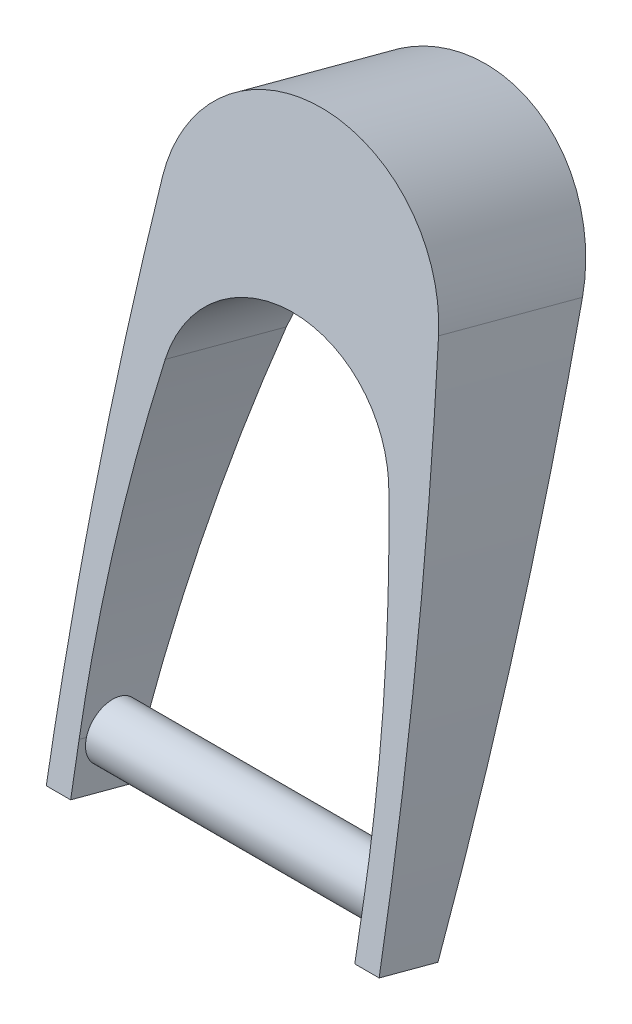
ISO-10303-21;
HEADER;
FILE_DESCRIPTION(('STEP AP214'),'2;1');
FILE_NAME('part.step','',(''),(''),'','','');
FILE_SCHEMA(('AUTOMOTIVE_DESIGN { 1 0 10303 214 1 1 1 1 }'));
ENDSEC;
DATA;
#1=APPLICATION_CONTEXT('core data for automotive mechanical design processes');
#2=APPLICATION_PROTOCOL_DEFINITION('international standard','automotive_design',2000,#1);
#3=PRODUCT_CONTEXT('',#1,'mechanical');
#4=PRODUCT('Part','Part','',(#3));
#5=PRODUCT_RELATED_PRODUCT_CATEGORY('part','',(#4));
#6=PRODUCT_DEFINITION_FORMATION('','',#4);
#7=PRODUCT_DEFINITION_CONTEXT('part definition',#1,'design');
#8=PRODUCT_DEFINITION('design','',#6,#7);
#9=PRODUCT_DEFINITION_SHAPE('','',#8);
#10=(LENGTH_UNIT() NAMED_UNIT(*) SI_UNIT(.MILLI.,.METRE.));
#11=(NAMED_UNIT(*) PLANE_ANGLE_UNIT() SI_UNIT($,.RADIAN.));
#12=(NAMED_UNIT(*) SI_UNIT($,.STERADIAN.) SOLID_ANGLE_UNIT());
#13=UNCERTAINTY_MEASURE_WITH_UNIT(LENGTH_MEASURE(1.E-05),#10,'distance_accuracy_value','');
#14=(GEOMETRIC_REPRESENTATION_CONTEXT(3) GLOBAL_UNCERTAINTY_ASSIGNED_CONTEXT((#13)) GLOBAL_UNIT_ASSIGNED_CONTEXT((#10,
#11,#12)) REPRESENTATION_CONTEXT('',''));
#15=CARTESIAN_POINT('',(0.,0.,0.));
#16=DIRECTION('',(0.,0.,1.));
#17=DIRECTION('',(1.,0.,0.));
#18=AXIS2_PLACEMENT_3D('',#15,#16,#17);
#19=CARTESIAN_POINT('',(-414.876623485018,1.94114283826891,7.24444369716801));
#20=DIRECTION('',(0.,-0.258819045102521,-0.965925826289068));
#21=DIRECTION('',(-1.,0.,0.));
#22=AXIS2_PLACEMENT_3D('',#19,#20,#21);
#23=ELLIPSE('',#22,449.876623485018,434.547449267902);
#24=DIRECTION('',(0.,-0.258819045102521,-0.965925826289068));
#25=VECTOR('',#24,1.);
#26=SURFACE_OF_LINEAR_EXTRUSION('',#23,#25);
#27=CARTESIAN_POINT('',(35.0000000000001,1.73028855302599,6.45752479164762));
#28=CARTESIAN_POINT('',(35.0000012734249,1.91190148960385,6.40888269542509));
#29=CARTESIAN_POINT('',(34.9998737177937,2.09144855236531,6.35254195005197));
#30=CARTESIAN_POINT('',(34.9993701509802,2.44515491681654,6.22495098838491));
#31=CARTESIAN_POINT('',(34.9989941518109,2.61931447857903,6.15370149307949));
#32=CARTESIAN_POINT('',(34.998003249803,2.96088664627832,5.99683162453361));
#33=CARTESIAN_POINT('',(34.9973885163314,3.12830394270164,5.91122146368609));
#34=CARTESIAN_POINT('',(34.9959379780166,3.45533297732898,5.72621057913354));
#35=CARTESIAN_POINT('',(34.9951021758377,3.61494480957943,5.62681002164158));
#36=CARTESIAN_POINT('',(34.993232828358,3.92527485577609,5.41489215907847));
#37=CARTESIAN_POINT('',(34.9921992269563,4.07599053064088,5.3023711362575));
#38=CARTESIAN_POINT('',(34.9899633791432,4.3674621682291,5.06499141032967));
#39=CARTESIAN_POINT('',(34.988761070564,4.50821443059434,4.94012816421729));
#40=CARTESIAN_POINT('',(34.9862229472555,4.77862072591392,4.67906059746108));
#41=CARTESIAN_POINT('',(34.9848872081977,4.90828097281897,4.54286271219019));
#42=CARTESIAN_POINT('',(34.9821190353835,5.1557169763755,4.25998029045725));
#43=CARTESIAN_POINT('',(34.980686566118,5.27348832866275,4.11329190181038));
#44=CARTESIAN_POINT('',(34.9777664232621,5.49622511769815,3.8105564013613));
#45=CARTESIAN_POINT('',(34.9762787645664,5.60119397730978,3.65451180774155));
#46=CARTESIAN_POINT('',(34.9732895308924,5.79765326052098,3.33407755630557));
#47=CARTESIAN_POINT('',(34.9717879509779,5.88913869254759,3.16968483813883));
#48=CARTESIAN_POINT('',(34.9688143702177,6.05791612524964,2.83381254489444));
#49=CARTESIAN_POINT('',(34.9673423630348,6.13521119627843,2.66233451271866));
#50=CARTESIAN_POINT('',(34.9644688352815,6.27510889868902,2.31341214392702));
#51=CARTESIAN_POINT('',(34.9630673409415,6.33770609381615,2.13596562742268));
#52=CARTESIAN_POINT('',(34.9603757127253,6.44770615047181,1.77649311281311));
#53=CARTESIAN_POINT('',(34.9590855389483,6.49511447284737,1.59446878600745));
#54=CARTESIAN_POINT('',(34.956652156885,6.57444506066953,1.22700480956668));
#55=CARTESIAN_POINT('',(34.9555090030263,6.60636160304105,1.04156392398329));
#56=CARTESIAN_POINT('',(34.9534031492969,6.65444482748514,0.668732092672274));
#57=CARTESIAN_POINT('',(34.9524403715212,6.67061832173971,0.481342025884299));
#58=CARTESIAN_POINT('',(34.9507216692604,6.68712734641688,0.105795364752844));
#59=CARTESIAN_POINT('',(34.9499658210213,6.68745704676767,-0.0823614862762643));
#60=CARTESIAN_POINT('',(34.9486830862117,6.67226318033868,-0.457985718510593));
#61=CARTESIAN_POINT('',(34.9481561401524,6.65674373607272,-0.64545326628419));
#62=CARTESIAN_POINT('',(34.9473458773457,6.60996753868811,-1.01841920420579));
#63=CARTESIAN_POINT('',(34.9470625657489,6.57871045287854,-1.20391755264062));
#64=CARTESIAN_POINT('',(34.9467476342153,6.50068049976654,-1.57162418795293));
#65=CARTESIAN_POINT('',(34.9467160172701,6.45390744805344,-1.7538324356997));
#66=CARTESIAN_POINT('',(34.9469053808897,6.34517825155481,-2.11366092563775));
#67=CARTESIAN_POINT('',(34.947126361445,6.28322210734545,-2.29128116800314));
#68=CARTESIAN_POINT('',(34.9478146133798,6.14457362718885,-2.64065484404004));
#69=CARTESIAN_POINT('',(34.9482818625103,6.06788262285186,-2.81240880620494));
#70=CARTESIAN_POINT('',(34.9494493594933,5.90030796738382,-3.14884220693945));
#71=CARTESIAN_POINT('',(34.9501496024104,5.80942461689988,-3.31352179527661));
#72=CARTESIAN_POINT('',(34.9517633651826,5.61409157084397,-3.63467059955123));
#73=CARTESIAN_POINT('',(34.9526769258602,5.50963928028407,-3.79113823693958));
#74=CARTESIAN_POINT('',(34.9546909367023,5.28796567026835,-4.09466083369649));
#75=CARTESIAN_POINT('',(34.9557913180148,5.17074906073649,-4.24171923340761));
#76=CARTESIAN_POINT('',(34.9581485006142,4.92429399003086,-4.52550412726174));
#77=CARTESIAN_POINT('',(34.9594053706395,4.79505025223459,-4.66222603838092));
#78=CARTESIAN_POINT('',(34.9620389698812,4.52555370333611,-4.92424576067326));
#79=CARTESIAN_POINT('',(34.9634156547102,4.38530497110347,-5.04954776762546));
#80=CARTESIAN_POINT('',(34.9662506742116,4.09470665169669,-5.28793270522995));
#81=CARTESIAN_POINT('',(34.9677090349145,3.94435384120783,-5.40101170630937));
#82=CARTESIAN_POINT('',(34.9706650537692,3.63471368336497,-5.61406138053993));
#83=CARTESIAN_POINT('',(34.9721626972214,3.47542965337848,-5.71403687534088));
#84=CARTESIAN_POINT('',(34.9751558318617,3.14895132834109,-5.90025071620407));
#85=CARTESIAN_POINT('',(34.976651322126,2.98175431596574,-5.98648429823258));
#86=CARTESIAN_POINT('',(34.9795966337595,2.64075261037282,-6.14453031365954));
#87=CARTESIAN_POINT('',(34.9810464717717,2.46695037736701,-6.21634805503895));
#88=CARTESIAN_POINT('',(34.983860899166,2.11379310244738,-6.34513628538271));
#89=CARTESIAN_POINT('',(34.9852254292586,1.9344343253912,-6.40209653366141));
#90=CARTESIAN_POINT('',(34.9878289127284,1.57162082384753,-6.50068134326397));
#91=CARTESIAN_POINT('',(34.9890679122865,1.38816763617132,-6.54231155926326));
#92=CARTESIAN_POINT('',(34.9913868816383,1.01822352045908,-6.61000311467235));
#93=CARTESIAN_POINT('',(34.9924666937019,0.831729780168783,-6.63604908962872));
#94=CARTESIAN_POINT('',(34.9944347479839,0.457278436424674,-6.67231510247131));
#95=CARTESIAN_POINT('',(34.9953230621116,0.269321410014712,-6.68254108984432));
#96=CARTESIAN_POINT('',(34.9968825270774,-0.106574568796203,-6.68711160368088));
#97=CARTESIAN_POINT('',(34.997553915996,-0.294513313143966,-6.68147360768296));
#98=CARTESIAN_POINT('',(34.9986615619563,-0.669174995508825,-6.65439548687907));
#99=CARTESIAN_POINT('',(34.9990979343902,-0.85589848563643,-6.63296312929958));
#100=CARTESIAN_POINT('',(34.9996066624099,-1.15746048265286,-6.58541065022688));
#101=CARTESIAN_POINT('',(34.9997541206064,-1.27306882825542,-6.56404071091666));
#102=CARTESIAN_POINT('',(34.9999507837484,-1.50280874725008,-6.51527897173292));
#103=CARTESIAN_POINT('',(35.0000001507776,-1.61694244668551,-6.48789718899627));
#104=CARTESIAN_POINT('',(35.0000000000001,-1.73028855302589,-6.45752479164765));
#105=B_SPLINE_CURVE_WITH_KNOTS('',3,(#27,#28,#29,#30,#31,#32,#33,#34,#35,#36,#37,#38,#39,#40,
#41,#42,#43,#44,#45,#46,#47,#48,#49,#50,#51,#52,#53,#54,#55,#56,#57,#58,#59,#60,#61,#62,#63,#64,
#65,#66,#67,#68,#69,#70,#71,#72,#73,#74,#75,#76,#77,#78,#79,#80,#81,#82,#83,#84,#85,#86,#87,#88,
#89,#90,#91,#92,#93,#94,#95,#96,#97,#98,#99,#100,#101,#102,#103,#104),.UNSPECIFIED.,.F.,.F.,(4,
2,2,2,2,2,2,2,2,2,2,2,2,2,2,2,2,2,2,2,2,2,2,2,2,2,2,2,2,2,2,2,2,2,2,2,2,2,4),(0.,
0.563870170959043,1.12771307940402,1.69115670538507,2.25459354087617,2.81819041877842,
3.38199552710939,3.94548268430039,4.50917783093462,5.07272193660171,5.63647414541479,
6.20010423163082,6.76394245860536,7.32757774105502,7.89142108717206,8.45502034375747,
9.01882698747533,9.58248701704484,10.1461589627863,10.7098376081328,11.2735162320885,
11.8371439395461,12.4007597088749,12.9644834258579,13.5279998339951,14.0917646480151,
14.655321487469,15.2190589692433,15.7825884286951,16.346312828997,16.9098292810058,
17.4737331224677,18.0374287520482,18.601679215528,19.1657174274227,19.7291344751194,
20.2922746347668,20.6448252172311,20.9967927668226),.UNSPECIFIED.);
#106=CARTESIAN_POINT('',(35.0000000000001,1.73028855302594,6.45752479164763));
#107=VERTEX_POINT('',#106);
#108=CARTESIAN_POINT('',(35.0000000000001,-1.73028855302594,-6.45752479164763));
#109=VERTEX_POINT('',#108);
#110=EDGE_CURVE('E140',#107,#109,#105,.T.);
#111=ORIENTED_EDGE('',*,*,#110,.F.);
#112=DIRECTION('',(0.,-0.258819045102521,-0.965925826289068));
#113=VECTOR('',#112,1.);
#114=CARTESIAN_POINT('',(35.0000000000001,1.94114283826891,7.24444369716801));
#115=LINE('',#114,#113);
#116=CARTESIAN_POINT('',(35.0000000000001,2.21288899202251,8.25861414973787));
#117=VERTEX_POINT('',#116);
#118=EDGE_CURVE('E49',#117,#107,#115,.T.);
#119=ORIENTED_EDGE('',*,*,#118,.F.);
#120=CARTESIAN_POINT('',(-14.2672563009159,197.675538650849,-26.2067247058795));
#121=CARTESIAN_POINT('',(-12.9439949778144,195.202647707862,-25.7706873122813));
#122=CARTESIAN_POINT('',(-11.6455546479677,192.716958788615,-25.33239329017));
#123=CARTESIAN_POINT('',(-9.09881878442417,187.720787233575,-24.4514334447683));
#124=CARTESIAN_POINT('',(-7.85052331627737,185.210304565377,-24.008767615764));
#125=CARTESIAN_POINT('',(-4.18166416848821,177.642983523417,-22.6744447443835));
#126=CARTESIAN_POINT('',(-1.83707289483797,172.550169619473,-21.776444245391));
#127=CARTESIAN_POINT('',(2.6449229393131,162.277045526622,-19.9650152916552));
#128=CARTESIAN_POINT('',(4.78232766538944,157.096735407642,-19.051586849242));
#129=CARTESIAN_POINT('',(8.84610813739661,146.656500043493,-17.2106916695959));
#130=CARTESIAN_POINT('',(10.7724873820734,141.396576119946,-16.2832251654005));
#131=CARTESIAN_POINT('',(14.4106469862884,130.805359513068,-14.4157079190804));
#132=CARTESIAN_POINT('',(16.1224321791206,125.474068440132,-13.4756574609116));
#133=CARTESIAN_POINT('',(19.2686426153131,114.947897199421,-11.6196094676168));
#134=CARTESIAN_POINT('',(20.7110165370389,109.755319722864,-10.7040179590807));
#135=CARTESIAN_POINT('',(23.3913677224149,99.3195537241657,-8.86391084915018));
#136=CARTESIAN_POINT('',(24.6293567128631,94.0763681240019,-7.93939576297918));
#137=CARTESIAN_POINT('',(26.8988148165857,83.5471179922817,-6.08280487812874));
#138=CARTESIAN_POINT('',(27.9302950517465,78.2610557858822,-5.1507294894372));
#139=CARTESIAN_POINT('',(29.7849720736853,67.6538572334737,-3.2803941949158));
#140=CARTESIAN_POINT('',(30.608177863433,62.3327224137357,-2.34213455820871));
#141=CARTESIAN_POINT('',(32.0448982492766,51.6631710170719,-0.460804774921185));
#142=CARTESIAN_POINT('',(32.6584189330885,46.3147552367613,0.482265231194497));
#143=CARTESIAN_POINT('',(33.5901283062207,36.490546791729,2.21453824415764));
#144=CARTESIAN_POINT('',(33.940476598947,32.0176826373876,3.00322487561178));
#145=CARTESIAN_POINT('',(34.4943411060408,23.0629682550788,4.58218262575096));
#146=CARTESIAN_POINT('',(34.697852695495,18.5811177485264,5.37245379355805));
#147=CARTESIAN_POINT('',(34.9577730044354,9.61314668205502,6.95374905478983));
#148=CARTESIAN_POINT('',(35.01417699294,5.12702598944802,7.74477317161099));
#149=CARTESIAN_POINT('',(34.9798002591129,-3.84482670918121,9.32675286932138));
#150=CARTESIAN_POINT('',(34.8890144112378,-8.33055869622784,10.1177084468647));
#151=CARTESIAN_POINT('',(34.5603531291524,-17.2969635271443,11.69872753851));
#152=CARTESIAN_POINT('',(34.3224721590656,-21.7776361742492,12.488791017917));
#153=CARTESIAN_POINT('',(33.699897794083,-30.7292455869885,14.0672012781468));
#154=CARTESIAN_POINT('',(33.315198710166,-35.2001819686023,14.8555479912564));
#155=CARTESIAN_POINT('',(32.3817732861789,-44.2999117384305,16.4600758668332));
#156=CARTESIAN_POINT('',(31.8272858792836,-48.9281329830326,17.2761561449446));
#157=CARTESIAN_POINT('',(30.5611683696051,-58.1637661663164,18.904647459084));
#158=CARTESIAN_POINT('',(29.8495351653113,-62.7711776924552,19.7170584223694));
#159=CARTESIAN_POINT('',(28.2700476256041,-71.9600892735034,21.3373114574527));
#160=CARTESIAN_POINT('',(27.4021889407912,-76.5415886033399,22.1451534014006));
#161=CARTESIAN_POINT('',(25.5113750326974,-85.673602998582,23.7553739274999));
#162=CARTESIAN_POINT('',(24.4884144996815,-90.2241169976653,24.5577523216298));
#163=CARTESIAN_POINT('',(22.2887062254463,-99.2891256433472,26.1561579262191));
#164=CARTESIAN_POINT('',(21.1119528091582,-103.803618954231,26.9521849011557));
#165=CARTESIAN_POINT('',(18.6062182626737,-112.79161070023,28.5370103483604));
#166=CARTESIAN_POINT('',(17.2772319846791,-117.265107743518,29.3258085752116));
#167=CARTESIAN_POINT('',(15.8729342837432,-121.715550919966,30.1105417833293));
#168=B_SPLINE_CURVE_WITH_KNOTS('',3,(#120,#121,#122,#123,#124,#125,#126,#127,#128,#129,#130,
#131,#132,#133,#134,#135,#136,#137,#138,#139,#140,#141,#142,#143,#144,#145,#146,#147,#148,#149,
#150,#151,#152,#153,#154,#155,#156,#157,#158,#159,#160,#161,#162,#163,#164,#165,#166,#167),
.UNSPECIFIED.,.F.,.F.,(4,2,2,2,2,2,2,2,2,2,2,2,2,2,2,2,2,2,2,2,2,2,2,4),(0.,8.51481807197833,
17.029647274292,34.0589529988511,51.0882451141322,68.1172548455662,85.1458809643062,
101.541073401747,117.935324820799,134.328693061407,150.721352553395,167.113536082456,
180.777321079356,194.441536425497,208.106191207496,221.771321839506,235.436966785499,
249.103141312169,263.297115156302,277.491369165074,291.686018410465,305.881153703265,
320.076812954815,334.272952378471),.UNSPECIFIED.);
#169=CARTESIAN_POINT('',(27.5354091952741,80.143252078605,-5.48261147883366));
#170=VERTEX_POINT('',#169);
#171=EDGE_CURVE('E128',#170,#117,#168,.T.);
#172=ORIENTED_EDGE('',*,*,#171,.F.);
#173=DIRECTION('',(0.,-0.258819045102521,-0.965925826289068));
#174=VECTOR('',#173,1.);
#175=CARTESIAN_POINT('',(27.5354091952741,78.0864678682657,-13.158634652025));
#176=LINE('',#175,#174);
#177=CARTESIAN_POINT('',(27.5354091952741,72.1473979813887,-35.3235452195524));
#178=VERTEX_POINT('',#177);
#179=EDGE_CURVE('E123',#170,#178,#176,.T.);
#180=ORIENTED_EDGE('',*,*,#179,.T.);
#181=CARTESIAN_POINT('',(-14.6773327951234,185.02483755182,-76.4075733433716));
#182=CARTESIAN_POINT('',(-13.3417294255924,182.654931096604,-75.5449979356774));
#183=CARTESIAN_POINT('',(-12.0311877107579,180.272633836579,-74.6779126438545));
#184=CARTESIAN_POINT('',(-9.46074033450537,175.484034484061,-72.9350050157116));
#185=CARTESIAN_POINT('',(-8.2008347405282,173.077732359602,-72.059182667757));
#186=CARTESIAN_POINT('',(-4.49789806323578,165.824094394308,-69.4190743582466));
#187=CARTESIAN_POINT('',(-2.13159124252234,160.941927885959,-67.6421110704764));
#188=CARTESIAN_POINT('',(2.39173914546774,151.092887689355,-64.0573536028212));
#189=CARTESIAN_POINT('',(4.5487629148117,146.126014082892,-62.2495594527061));
#190=CARTESIAN_POINT('',(8.6496086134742,136.115196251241,-58.605919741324));
#191=CARTESIAN_POINT('',(10.5934341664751,131.071253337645,-56.7700746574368));
#192=CARTESIAN_POINT('',(14.264243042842,120.914288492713,-53.0732417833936));
#193=CARTESIAN_POINT('',(15.9912313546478,115.801268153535,-51.2122545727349));
#194=CARTESIAN_POINT('',(19.1644163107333,105.707438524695,-47.5384010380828));
#195=CARTESIAN_POINT('',(20.61872493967,100.728879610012,-45.7263537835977));
#196=CARTESIAN_POINT('',(23.3209199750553,90.7228343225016,-42.0844511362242));
#197=CARTESIAN_POINT('',(24.5688184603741,85.6953508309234,-40.2545967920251));
#198=CARTESIAN_POINT('',(26.8560319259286,75.598944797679,-36.5798055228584));
#199=CARTESIAN_POINT('',(27.8953583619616,70.5300245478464,-34.7348694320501));
#200=CARTESIAN_POINT('',(29.7636333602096,60.3583041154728,-31.0326659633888));
#201=CARTESIAN_POINT('',(30.5925911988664,55.2555054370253,-29.175399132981));
#202=CARTESIAN_POINT('',(32.0386975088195,45.0235757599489,-25.4512812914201));
#203=CARTESIAN_POINT('',(32.6558522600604,39.8944455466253,-23.5844305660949));
#204=CARTESIAN_POINT('',(33.5922695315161,30.472928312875,-20.1552787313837));
#205=CARTESIAN_POINT('',(33.9440167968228,26.1833637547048,-18.5940049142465));
#206=CARTESIAN_POINT('',(34.4991892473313,17.5955939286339,-15.4683123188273));
#207=CARTESIAN_POINT('',(34.7026096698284,13.2973883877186,-13.903893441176));
#208=CARTESIAN_POINT('',(34.9608546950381,4.69690510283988,-10.7735735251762));
#209=CARTESIAN_POINT('',(35.0156744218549,0.394627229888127,-9.20767243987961));
#210=CARTESIAN_POINT('',(34.9766370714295,-8.20948777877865,-6.0760306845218));
#211=CARTESIAN_POINT('',(34.8827747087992,-12.511324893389,-4.51029002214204));
#212=CARTESIAN_POINT('',(34.5464727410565,-21.1100342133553,-1.3806157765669));
#213=CARTESIAN_POINT('',(34.3040274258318,-25.4069062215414,0.18331773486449));
#214=CARTESIAN_POINT('',(33.6708448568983,-33.9911550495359,3.30772879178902));
#215=CARTESIAN_POINT('',(33.2801017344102,-38.278531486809,4.86820619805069));
#216=CARTESIAN_POINT('',(32.3326718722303,-47.0061747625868,8.04480856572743));
#217=CARTESIAN_POINT('',(31.7701044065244,-51.4458788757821,9.66072871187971));
#218=CARTESIAN_POINT('',(30.4861385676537,-60.3050425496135,12.8852005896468));
#219=CARTESIAN_POINT('',(29.7647369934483,-64.7245017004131,14.4937521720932));
#220=CARTESIAN_POINT('',(28.1640471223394,-73.5382289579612,17.7016865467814));
#221=CARTESIAN_POINT('',(27.2847543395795,-77.9324963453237,19.3010690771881));
#222=CARTESIAN_POINT('',(25.3694335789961,-86.6909224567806,22.4888754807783));
#223=CARTESIAN_POINT('',(24.3334001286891,-91.0550801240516,24.0772989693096));
#224=CARTESIAN_POINT('',(22.1059382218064,-99.7484062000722,27.2414108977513));
#225=CARTESIAN_POINT('',(20.914503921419,-104.077573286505,28.8170988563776));
#226=CARTESIAN_POINT('',(18.3778359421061,-112.696096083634,31.9539846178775));
#227=CARTESIAN_POINT('',(17.0325969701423,-116.985450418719,33.515181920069));
#228=CARTESIAN_POINT('',(15.6112794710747,-121.252421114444,35.0682322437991));
#229=B_SPLINE_CURVE_WITH_KNOTS('',3,(#181,#182,#183,#184,#185,#186,#187,#188,#189,#190,#191,
#192,#193,#194,#195,#196,#197,#198,#199,#200,#201,#202,#203,#204,#205,#206,#207,#208,#209,#210,
#211,#212,#213,#214,#215,#216,#217,#218,#219,#220,#221,#222,#223,#224,#225,#226,#227,#228),
.UNSPECIFIED.,.F.,.F.,(4,2,2,2,2,2,2,2,2,2,2,2,2,2,2,2,2,2,2,2,2,2,2,4),(0.,8.56118772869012,
17.1223868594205,34.2444274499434,51.3664515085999,68.4881845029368,85.6095235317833,
102.08758050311,118.564672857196,135.04085996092,151.516320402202,167.991292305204,
181.724142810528,195.457434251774,209.191176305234,222.925406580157,236.660164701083,
250.395466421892,264.666773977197,278.93836917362,293.210369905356,307.482869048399,
321.755905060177,336.029432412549),.UNSPECIFIED.);
#230=CARTESIAN_POINT('',(35.0000000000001,-2.21288899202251,-8.25861414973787));
#231=VERTEX_POINT('',#230);
#232=EDGE_CURVE('E132',#178,#231,#229,.T.);
#233=ORIENTED_EDGE('',*,*,#232,.T.);
#234=EDGE_CURVE('E286',#109,#231,#115,.T.);
#235=ORIENTED_EDGE('',*,*,#234,.F.);
#236=EDGE_LOOP('',(#111,#119,#172,#180,#233,#235));
#237=FACE_BOUND('',#236,.T.);
#238=ADVANCED_FACE('F33',(#237),#26,.F.);
#239=CARTESIAN_POINT('',(414.876623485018,1.94114283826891,7.24444369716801));
#240=DIRECTION('',(0.,-0.258819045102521,-0.965925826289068));
#241=DIRECTION('',(1.,0.,0.));
#242=AXIS2_PLACEMENT_3D('',#239,#240,#241);
#243=ELLIPSE('',#242,449.876623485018,434.547449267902);
#244=DIRECTION('',(0.,-0.258819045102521,-0.965925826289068));
#245=VECTOR('',#244,1.);
#246=SURFACE_OF_LINEAR_EXTRUSION('',#243,#245);
#247=CARTESIAN_POINT('',(-35.0000000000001,-1.73028855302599,-6.45752479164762));
#248=CARTESIAN_POINT('',(-35.0000012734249,-1.54868608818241,-6.50620596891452));
#249=CARTESIAN_POINT('',(-34.9998737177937,-1.36502339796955,-6.54718698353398));
#250=CARTESIAN_POINT('',(-34.9993701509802,-0.994909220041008,-6.61354315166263));
#251=CARTESIAN_POINT('',(-34.9989941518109,-0.808457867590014,-6.63891905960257));
#252=CARTESIAN_POINT('',(-34.998003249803,-0.434212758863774,-6.67385185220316));
#253=CARTESIAN_POINT('',(-34.9973885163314,-0.246420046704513,-6.6834199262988));
#254=CARTESIAN_POINT('',(-34.9959379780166,0.129300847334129,-6.68671031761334));
#255=CARTESIAN_POINT('',(-34.9951021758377,0.317229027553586,-6.68043282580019));
#256=CARTESIAN_POINT('',(-34.993232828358,0.691941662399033,-6.65207159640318));
#257=CARTESIAN_POINT('',(-34.9921992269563,0.878725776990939,-6.6299833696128));
#258=CARTESIAN_POINT('',(-34.9899633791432,1.2498374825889,-6.57014231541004));
#259=CARTESIAN_POINT('',(-34.988761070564,1.43416414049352,-6.53238370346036));
#260=CARTESIAN_POINT('',(-34.9862229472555,1.79887664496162,-6.44149570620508));
#261=CARTESIAN_POINT('',(-34.9848872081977,1.9792646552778,-6.38837500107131));
#262=CARTESIAN_POINT('',(-34.9821190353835,2.33499173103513,-6.26710963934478));
#263=CARTESIAN_POINT('',(-34.980686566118,2.51032890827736,-6.19895944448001));
#264=CARTESIAN_POINT('',(-34.9777664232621,2.85459237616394,-6.04815120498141));
#265=CARTESIAN_POINT('',(-34.9762787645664,3.02352037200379,-5.96549705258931));
#266=CARTESIAN_POINT('',(-34.9732895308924,3.35387622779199,-5.78622249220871));
#267=CARTESIAN_POINT('',(-34.9717879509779,3.51530129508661,-5.68959693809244));
#268=CARTESIAN_POINT('',(-34.9688143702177,3.82940298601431,-5.48311171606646));
#269=CARTESIAN_POINT('',(-34.9673423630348,3.98208149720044,-5.37325491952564));
#270=CARTESIAN_POINT('',(-34.9644688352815,4.27769764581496,-5.14102813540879));
#271=CARTESIAN_POINT('',(-34.9630673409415,4.42063166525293,-5.0186535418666));
#272=CARTESIAN_POINT('',(-34.9603757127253,4.69563076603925,-4.76234124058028));
#273=CARTESIAN_POINT('',(-34.9590855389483,4.82769974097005,-4.62840771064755));
#274=CARTESIAN_POINT('',(-34.956652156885,5.08013403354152,-4.34983986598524));
#275=CARTESIAN_POINT('',(-34.9555090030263,5.20049501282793,-4.20520161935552));
#276=CARTESIAN_POINT('',(-34.9534031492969,5.4285522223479,-3.90636139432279));
#277=CARTESIAN_POINT('',(-34.9524403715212,5.53625391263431,-3.75216358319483));
#278=CARTESIAN_POINT('',(-34.9507216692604,5.73832447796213,-3.43518514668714));
#279=CARTESIAN_POINT('',(-34.9499658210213,5.83268843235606,-3.27240138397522));
#280=CARTESIAN_POINT('',(-34.9486830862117,6.00734227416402,-2.93950432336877));
#281=CARTESIAN_POINT('',(-34.9481561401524,6.08763581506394,-2.76939294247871));
#282=CARTESIAN_POINT('',(-34.9473458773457,6.23360940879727,-2.42300686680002));
#283=CARTESIAN_POINT('',(-34.9470625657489,6.29928915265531,-2.2467320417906));
#284=CARTESIAN_POINT('',(-34.9467476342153,6.41556654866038,-1.88927377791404));
#285=CARTESIAN_POINT('',(-34.9467160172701,6.46616402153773,-1.70809028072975));
#286=CARTESIAN_POINT('',(-34.9469053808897,6.55191602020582,-1.34210506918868));
#287=CARTESIAN_POINT('',(-34.947126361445,6.58707054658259,-1.1573033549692));
#288=CARTESIAN_POINT('',(-34.9478146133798,6.64168427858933,-0.785412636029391));
#289=CARTESIAN_POINT('',(-34.9482818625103,6.66114490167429,-0.598323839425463));
#290=CARTESIAN_POINT('',(-34.9494493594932,6.68423769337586,-0.223176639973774));
#291=CARTESIAN_POINT('',(-34.9501496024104,6.68787019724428,-0.0351182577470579));
#292=CARTESIAN_POINT('',(-34.9517633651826,6.67928121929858,0.340671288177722));
#293=CARTESIAN_POINT('',(-34.9526769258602,6.66705670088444,0.528402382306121));
#294=CARTESIAN_POINT('',(-34.9546909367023,6.62684302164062,0.90209746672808));
#295=CARTESIAN_POINT('',(-34.9557913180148,6.59885965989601,1.08806208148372));
#296=CARTESIAN_POINT('',(-34.9581485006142,6.52731575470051,1.45705454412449));
#297=CARTESIAN_POINT('',(-34.9594053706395,6.48374835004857,1.64008106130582));
#298=CARTESIAN_POINT('',(-34.9620389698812,6.3813673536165,2.00174507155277));
#299=CARTESIAN_POINT('',(-34.9634156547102,6.32255939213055,2.18038415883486));
#300=CARTESIAN_POINT('',(-34.9662506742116,6.19008633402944,2.53213073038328));
#301=CARTESIAN_POINT('',(-34.9677090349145,6.11641648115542,2.70523642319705));
#302=CARTESIAN_POINT('',(-34.9706650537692,5.95478507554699,3.04456293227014));
#303=CARTESIAN_POINT('',(-34.9721626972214,5.86682880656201,3.21078626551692));
#304=CARTESIAN_POINT('',(-34.9751558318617,5.67719720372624,3.53529134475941));
#305=CARTESIAN_POINT('',(-34.9766513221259,5.57551713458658,3.6935703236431));
#306=CARTESIAN_POINT('',(-34.9795966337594,5.35922400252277,4.00094304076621));
#307=CARTESIAN_POINT('',(-34.9810464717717,5.24461572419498,4.15004014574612));
#308=CARTESIAN_POINT('',(-34.983860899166,5.00316666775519,4.43815266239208));
#309=CARTESIAN_POINT('',(-34.9852254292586,4.87631753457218,4.5771610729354));
#310=CARTESIAN_POINT('',(-34.9878289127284,4.61140423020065,4.8439447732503));
#311=CARTESIAN_POINT('',(-34.9890679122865,4.47334421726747,4.97172419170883));
#312=CARTESIAN_POINT('',(-34.9913868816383,4.18680899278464,5.21531885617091));
#313=CARTESIAN_POINT('',(-34.9924666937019,4.03832366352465,5.33112220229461));
#314=CARTESIAN_POINT('',(-34.9944347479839,3.73217229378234,5.54975516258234));
#315=CARTESIAN_POINT('',(-34.9953230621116,3.57450972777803,5.65258964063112));
#316=CARTESIAN_POINT('',(-34.9968825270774,3.25125951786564,5.84449581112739));
#317=CARTESIAN_POINT('',(-34.997553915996,3.08568079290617,5.93358253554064));
#318=CARTESIAN_POINT('',(-34.9986615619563,2.74767519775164,6.09746303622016));
#319=CARTESIAN_POINT('',(-34.9990979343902,2.5752517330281,6.17226381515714));
#320=CARTESIAN_POINT('',(-34.9996066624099,2.29031514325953,6.28186315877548));
#321=CARTESIAN_POINT('',(-34.9997541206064,2.17951040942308,6.3211604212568));
#322=CARTESIAN_POINT('',(-34.9999507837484,1.95616893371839,6.39380147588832));
#323=CARTESIAN_POINT('',(-35.0000001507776,1.84363535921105,6.4271550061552));
#324=CARTESIAN_POINT('',(-35.0000000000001,1.73028855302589,6.45752479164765));
#325=B_SPLINE_CURVE_WITH_KNOTS('',3,(#247,#248,#249,#250,#251,#252,#253,#254,#255,#256,#257,
#258,#259,#260,#261,#262,#263,#264,#265,#266,#267,#268,#269,#270,#271,#272,#273,#274,#275,#276,
#277,#278,#279,#280,#281,#282,#283,#284,#285,#286,#287,#288,#289,#290,#291,#292,#293,#294,#295,
#296,#297,#298,#299,#300,#301,#302,#303,#304,#305,#306,#307,#308,#309,#310,#311,#312,#313,#314,
#315,#316,#317,#318,#319,#320,#321,#322,#323,#324),.UNSPECIFIED.,.F.,.F.,(4,2,2,2,2,2,2,2,2,2,2,
2,2,2,2,2,2,2,2,2,2,2,2,2,2,2,2,2,2,2,2,2,2,2,2,2,2,2,4),(0.,0.563870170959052,1.12771307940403,
1.69115670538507,2.25459354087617,2.8181904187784,3.38199552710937,3.94548268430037,
4.50917783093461,5.07272193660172,5.63647414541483,6.20010423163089,6.76394245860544,
7.32757774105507,7.89142108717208,8.45502034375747,9.01882698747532,9.58248701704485,
10.1461589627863,10.7098376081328,11.2735162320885,11.8371439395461,12.400759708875,
12.964483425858,13.5279998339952,14.0917646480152,14.6553214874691,15.2190589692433,
15.7825884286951,16.346312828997,16.9098292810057,17.4737331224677,18.0374287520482,
18.601679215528,19.1657174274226,19.7291344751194,20.2922746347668,20.6448252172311,
20.9967927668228),.UNSPECIFIED.);
#326=CARTESIAN_POINT('',(-35.0000000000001,-1.73028855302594,-6.45752479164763));
#327=VERTEX_POINT('',#326);
#328=CARTESIAN_POINT('',(-35.0000000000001,1.73028855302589,6.45752479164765));
#329=VERTEX_POINT('',#328);
#330=EDGE_CURVE('E11',#327,#329,#325,.T.);
#331=ORIENTED_EDGE('',*,*,#330,.F.);
#332=DIRECTION('',(0.,-0.258819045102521,-0.965925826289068));
#333=VECTOR('',#332,1.);
#334=CARTESIAN_POINT('',(-35.0000000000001,1.94114283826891,7.24444369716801));
#335=LINE('',#334,#333);
#336=CARTESIAN_POINT('',(-35.0000000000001,-2.21288899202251,-8.25861414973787));
#337=VERTEX_POINT('',#336);
#338=EDGE_CURVE('E309',#327,#337,#335,.T.);
#339=ORIENTED_EDGE('',*,*,#338,.T.);
#340=CARTESIAN_POINT('',(-35.0000000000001,-2.21288899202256,-8.25861414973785));
#341=CARTESIAN_POINT('',(-35.0000196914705,1.56730739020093,-9.63449311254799));
#342=CARTESIAN_POINT('',(-34.9426080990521,5.34750182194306,-11.010371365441));
#343=CARTESIAN_POINT('',(-34.7135205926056,12.8897859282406,-13.7555382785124));
#344=CARTESIAN_POINT('',(-34.5422999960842,16.6518878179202,-15.1248313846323));
#345=CARTESIAN_POINT('',(-34.0869121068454,24.1580790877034,-17.8568615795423));
#346=CARTESIAN_POINT('',(-33.8031047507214,27.9021877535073,-19.2196056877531));
#347=CARTESIAN_POINT('',(-33.1236225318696,35.372469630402,-21.938565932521));
#348=CARTESIAN_POINT('',(-32.7282150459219,39.098664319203,-23.2947898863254));
#349=CARTESIAN_POINT('',(-31.8263448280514,46.5331791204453,-26.0007319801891));
#350=CARTESIAN_POINT('',(-31.320059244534,50.2415182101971,-27.3504570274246));
#351=CARTESIAN_POINT('',(-30.1969938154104,57.6403672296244,-30.0434178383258));
#352=CARTESIAN_POINT('',(-29.5803026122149,61.3308890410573,-31.3866579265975));
#353=CARTESIAN_POINT('',(-28.2367410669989,68.6941047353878,-34.0666492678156));
#354=CARTESIAN_POINT('',(-27.5098728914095,72.3667989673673,-35.4034006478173));
#355=CARTESIAN_POINT('',(-25.945989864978,79.694514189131,-38.0704708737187));
#356=CARTESIAN_POINT('',(-25.1088862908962,83.3495184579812,-39.4007836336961));
#357=CARTESIAN_POINT('',(-23.3243391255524,90.6418070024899,-42.0549596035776));
#358=CARTESIAN_POINT('',(-22.3767215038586,94.2790536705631,-43.3788091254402));
#359=CARTESIAN_POINT('',(-20.3707119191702,101.535726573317,-46.0200220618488));
#360=CARTESIAN_POINT('',(-19.3120613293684,105.155089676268,-47.3373624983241));
#361=CARTESIAN_POINT('',(-17.0832995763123,112.375836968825,-49.9654995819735));
#362=CARTESIAN_POINT('',(-15.9128453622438,115.977127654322,-51.2762621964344));
#363=CARTESIAN_POINT('',(-13.459564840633,123.161526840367,-53.891169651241));
#364=CARTESIAN_POINT('',(-12.176310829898,126.744506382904,-55.1952675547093));
#365=CARTESIAN_POINT('',(-10.8394320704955,130.309726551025,-56.4929015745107));
#366=B_SPLINE_CURVE_WITH_KNOTS('',3,(#340,#341,#342,#343,#344,#345,#346,#347,#348,#349,#350,
#351,#352,#353,#354,#355,#356,#357,#358,#359,#360,#361,#362,#363,#364,#365),.UNSPECIFIED.,.F.,
.F.,(4,2,2,2,2,2,2,2,2,2,2,2,4),(0.,12.0679892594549,24.087986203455,36.0698613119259,
48.0232698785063,59.9577181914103,71.8826272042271,83.8073017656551,95.7416332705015,
107.695018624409,119.67689258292,131.696790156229,143.764410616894),.UNSPECIFIED.);
#367=CARTESIAN_POINT('',(-27.5354091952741,72.1473979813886,-35.3235452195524));
#368=VERTEX_POINT('',#367);
#369=EDGE_CURVE('E114',#337,#368,#366,.T.);
#370=ORIENTED_EDGE('',*,*,#369,.T.);
#371=DIRECTION('',(0.,-0.258819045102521,-0.965925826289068));
#372=VECTOR('',#371,1.);
#373=CARTESIAN_POINT('',(-27.5354091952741,78.0864678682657,-13.158634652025));
#374=LINE('',#373,#372);
#375=CARTESIAN_POINT('',(-27.5354091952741,80.1432520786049,-5.48261147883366));
#376=VERTEX_POINT('',#375);
#377=EDGE_CURVE('E125',#376,#368,#374,.T.);
#378=ORIENTED_EDGE('',*,*,#377,.F.);
#379=CARTESIAN_POINT('',(-27.5354091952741,80.143252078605,-5.48261147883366));
#380=CARTESIAN_POINT('',(-28.2833888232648,76.2715603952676,-4.79992777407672));
#381=CARTESIAN_POINT('',(-28.9757087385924,72.3894388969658,-4.11540501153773));
#382=CARTESIAN_POINT('',(-30.2459496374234,64.6227937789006,-2.74593592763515));
#383=CARTESIAN_POINT('',(-30.8243109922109,60.738340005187,-2.06100192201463));
#384=CARTESIAN_POINT('',(-31.8678155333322,52.9671628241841,-0.690733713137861));
#385=CARTESIAN_POINT('',(-32.3333096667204,49.0804851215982,-0.00540756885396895));
#386=CARTESIAN_POINT('',(-33.1520306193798,41.3049675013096,1.36562597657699));
#387=CARTESIAN_POINT('',(-33.5055202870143,37.4161544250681,2.05132864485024));
#388=CARTESIAN_POINT('',(-34.1009253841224,29.6364411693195,3.42310199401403));
#389=CARTESIAN_POINT('',(-34.3430164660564,25.7455540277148,4.10917037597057));
#390=CARTESIAN_POINT('',(-34.7160734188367,17.961738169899,5.4816671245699));
#391=CARTESIAN_POINT('',(-34.8471280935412,14.0688135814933,6.16809476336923));
#392=CARTESIAN_POINT('',(-34.9983176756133,6.28086721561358,7.54131983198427));
#393=CARTESIAN_POINT('',(-35.0184523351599,2.38584543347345,8.22811726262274));
#394=CARTESIAN_POINT('',(-34.9477543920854,-5.40633792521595,9.6020894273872));
#395=CARTESIAN_POINT('',(-34.8568329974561,-9.30349872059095,10.2892640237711));
#396=CARTESIAN_POINT('',(-34.5637257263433,-17.0999414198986,11.6639872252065));
#397=CARTESIAN_POINT('',(-34.3613638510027,-20.9992169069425,12.3515346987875));
#398=CARTESIAN_POINT('',(-33.8448342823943,-28.7998596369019,13.7269984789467));
#399=CARTESIAN_POINT('',(-33.5304027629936,-32.7012099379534,14.4149117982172));
#400=CARTESIAN_POINT('',(-32.7889354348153,-40.5059605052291,15.7910999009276));
#401=CARTESIAN_POINT('',(-32.3615467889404,-44.4093282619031,16.4793689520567));
#402=CARTESIAN_POINT('',(-31.3931386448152,-52.2180655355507,17.8562600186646));
#403=CARTESIAN_POINT('',(-30.851675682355,-56.1233817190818,18.5448726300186));
#404=CARTESIAN_POINT('',(-30.2541253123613,-60.0203565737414,19.2320144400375));
#405=B_SPLINE_CURVE_WITH_KNOTS('',3,(#379,#380,#381,#382,#383,#384,#385,#386,#387,#388,#389,
#390,#391,#392,#393,#394,#395,#396,#397,#398,#399,#400,#401,#402,#403,#404),.UNSPECIFIED.,.F.,
.F.,(4,2,2,2,2,2,2,2,2,2,2,2,4),(0.,12.0054214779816,23.9634989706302,35.8839032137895,
47.7761222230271,59.6495248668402,71.5134225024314,83.3773466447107,95.2507624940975,
107.142984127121,119.063388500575,131.021477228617,143.026940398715),.UNSPECIFIED.);
#406=CARTESIAN_POINT('',(-35.0000000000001,2.21288899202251,8.25861414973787));
#407=VERTEX_POINT('',#406);
#408=EDGE_CURVE('E252',#407,#376,#405,.F.);
#409=ORIENTED_EDGE('',*,*,#408,.F.);
#410=EDGE_CURVE('E306',#407,#329,#335,.T.);
#411=ORIENTED_EDGE('',*,*,#410,.T.);
#412=EDGE_LOOP('',(#331,#339,#370,#378,#409,#411));
#413=FACE_BOUND('',#412,.T.);
#414=ADVANCED_FACE('F159',(#413),#246,.F.);
#415=CARTESIAN_POINT('',(35.0000000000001,1.94114283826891,7.24444369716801));
#416=DIRECTION('',(1.,0.,0.));
#417=DIRECTION('',(0.,1.,0.));
#418=AXIS2_PLACEMENT_3D('',#415,#416,#417);
#419=PLANE('',#418);
#420=CARTESIAN_POINT('',(35.0000000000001,0.,0.));
#421=DIRECTION('',(1.,0.,0.));
#422=DIRECTION('',(0.,1.,0.));
#423=AXIS2_PLACEMENT_3D('',#420,#421,#422);
#424=CIRCLE('',#423,6.68532160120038);
#425=EDGE_CURVE('E58',#109,#107,#424,.F.);
#426=ORIENTED_EDGE('',*,*,#425,.F.);
#427=ORIENTED_EDGE('',*,*,#234,.T.);
#428=DIRECTION('',(0.,0.939692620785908,-0.342020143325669));
#429=VECTOR('',#428,1.);
#430=CARTESIAN_POINT('',(35.0000000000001,-3.52737332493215,-7.78018097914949));
#431=LINE('',#430,#429);
#432=CARTESIAN_POINT('',(35.,-13.5331641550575,-4.13837094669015));
#433=VERTEX_POINT('',#432);
#434=EDGE_CURVE('E139',#231,#433,#431,.F.);
#435=ORIENTED_EDGE('',*,*,#434,.T.);
#436=DIRECTION('',(0.,-0.258819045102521,-0.965925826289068));
#437=VECTOR('',#436,1.);
#438=CARTESIAN_POINT('',(35.,-9.65087847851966,10.3505164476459));
#439=LINE('',#438,#437);
#440=CARTESIAN_POINT('',(35.,-9.65087847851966,10.3505164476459));
#441=VERTEX_POINT('',#440);
#442=EDGE_CURVE('E287',#441,#433,#439,.T.);
#443=ORIENTED_EDGE('',*,*,#442,.F.);
#444=DIRECTION('',(0.,-0.984807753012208,0.173648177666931));
#445=VECTOR('',#444,1.);
#446=CARTESIAN_POINT('',(35.0000000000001,2.12277034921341,8.27450449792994));
#447=LINE('',#446,#445);
#448=EDGE_CURVE('E152',#117,#441,#447,.T.);
#449=ORIENTED_EDGE('',*,*,#448,.F.);
#450=ORIENTED_EDGE('',*,*,#118,.T.);
#451=EDGE_LOOP('',(#426,#427,#435,#443,#449,#450));
#452=FACE_BOUND('',#451,.T.);
#453=ADVANCED_FACE('F160',(#452),#419,.F.);
#454=CARTESIAN_POINT('',(35.,-9.65087847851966,10.3505164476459));
#455=DIRECTION('',(0.,0.965925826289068,-0.258819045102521));
#456=DIRECTION('',(0.,0.258819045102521,0.965925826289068));
#457=AXIS2_PLACEMENT_3D('',#454,#455,#456);
#458=PLANE('',#457);
#459=DIRECTION('',(-1.,0.,0.));
#460=VECTOR('',#459,1.);
#461=CARTESIAN_POINT('',(35.,-13.5331641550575,-4.13837094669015));
#462=LINE('',#461,#460);
#463=CARTESIAN_POINT('',(41.0000000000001,-13.5331641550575,-4.13837094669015));
#464=VERTEX_POINT('',#463);
#465=EDGE_CURVE('E142',#433,#464,#462,.F.);
#466=ORIENTED_EDGE('',*,*,#465,.T.);
#467=DIRECTION('',(0.,-0.258819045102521,-0.965925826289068));
#468=VECTOR('',#467,1.);
#469=CARTESIAN_POINT('',(41.0000000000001,-9.65087847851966,10.3505164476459));
#470=LINE('',#469,#468);
#471=CARTESIAN_POINT('',(41.0000000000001,-9.65087847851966,10.3505164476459));
#472=VERTEX_POINT('',#471);
#473=EDGE_CURVE('E291',#472,#464,#470,.T.);
#474=ORIENTED_EDGE('',*,*,#473,.F.);
#475=DIRECTION('',(1.,0.,0.));
#476=VECTOR('',#475,1.);
#477=CARTESIAN_POINT('',(35.,-9.65087847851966,10.3505164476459));
#478=LINE('',#477,#476);
#479=EDGE_CURVE('E276',#441,#472,#478,.T.);
#480=ORIENTED_EDGE('',*,*,#479,.F.);
#481=ORIENTED_EDGE('',*,*,#442,.T.);
#482=EDGE_LOOP('',(#466,#474,#480,#481));
#483=FACE_BOUND('',#482,.T.);
#484=ADVANCED_FACE('F184',(#483),#458,.F.);
#485=CARTESIAN_POINT('',(-1141.41018492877,-9.65087847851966,10.3505164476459));
#486=DIRECTION('',(0.,0.258819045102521,0.965925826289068));
#487=DIRECTION('',(-1.,0.,0.));
#488=AXIS2_PLACEMENT_3D('',#485,#486,#487);
#489=ELLIPSE('',#488,1182.41018492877,1142.12053488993);
#490=DIRECTION('',(0.,-0.258819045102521,-0.965925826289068));
#491=VECTOR('',#490,1.);
#492=SURFACE_OF_LINEAR_EXTRUSION('',#489,#491);
#493=CARTESIAN_POINT('',(40.9999999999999,-13.5331641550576,-4.1383709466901));
#494=CARTESIAN_POINT('',(41.0000001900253,-8.56537658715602,-5.94649775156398));
#495=CARTESIAN_POINT('',(40.9622873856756,-3.5976579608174,-7.75459946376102));
#496=CARTESIAN_POINT('',(40.8114499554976,6.33676707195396,-11.3704344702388));
#497=CARTESIAN_POINT('',(40.698325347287,11.3034734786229,-13.1781677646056));
#498=CARTESIAN_POINT('',(40.2470622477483,26.1610198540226,-18.5858723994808));
#499=CARTESIAN_POINT('',(39.7970318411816,36.0490635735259,-22.1848259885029));
#500=CARTESIAN_POINT('',(38.6001280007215,55.7776615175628,-29.3654484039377));
#501=CARTESIAN_POINT('',(37.8542005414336,65.6182668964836,-32.9471358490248));
#502=CARTESIAN_POINT('',(36.0683204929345,85.2523771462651,-40.0933675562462));
#503=CARTESIAN_POINT('',(35.0290706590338,95.0459383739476,-43.6579323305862));
#504=CARTESIAN_POINT('',(32.6586856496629,114.586070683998,-50.769958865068));
#505=CARTESIAN_POINT('',(31.3280160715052,124.332691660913,-54.3174387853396));
#506=CARTESIAN_POINT('',(28.3762647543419,143.779075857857,-61.3953437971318));
#507=CARTESIAN_POINT('',(26.7554159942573,153.478870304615,-64.9257802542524));
#508=CARTESIAN_POINT('',(23.2241346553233,172.831602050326,-71.9695985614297));
#509=CARTESIAN_POINT('',(21.3137077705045,182.48454026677,-75.4829807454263));
#510=CARTESIAN_POINT('',(17.2033563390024,201.743963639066,-82.4928375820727));
#511=CARTESIAN_POINT('',(15.0031986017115,211.350404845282,-85.9892962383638));
#512=CARTESIAN_POINT('',(10.3128738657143,230.516723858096,-92.9652658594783));
#513=CARTESIAN_POINT('',(7.82224945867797,240.076502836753,-96.444740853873));
#514=CARTESIAN_POINT('',(2.549862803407,259.149185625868,-103.386629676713));
#515=CARTESIAN_POINT('',(-0.232579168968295,268.661923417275,-106.848983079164));
#516=CARTESIAN_POINT('',(-6.09045311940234,287.640286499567,-113.756542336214));
#517=CARTESIAN_POINT('',(-9.166786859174,297.105666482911,-117.201658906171));
#518=CARTESIAN_POINT('',(-13.999537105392,311.25826341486,-122.352782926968));
#519=CARTESIAN_POINT('',(-15.6503254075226,315.977543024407,-124.070460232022));
#520=CARTESIAN_POINT('',(-19.0227267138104,325.393702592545,-127.497662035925));
#521=CARTESIAN_POINT('',(-20.7443397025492,330.09058255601,-129.207186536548));
#522=CARTESIAN_POINT('',(-22.5011914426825,334.775865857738,-130.912490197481));
#523=B_SPLINE_CURVE_WITH_KNOTS('',3,(#493,#494,#495,#496,#497,#498,#499,#500,#501,#502,#503,
#504,#505,#506,#507,#508,#509,#510,#511,#512,#513,#514,#515,#516,#517,#518,#519,#520,#521,#522),
.UNSPECIFIED.,.F.,.F.,(4,2,2,2,2,2,2,2,2,2,2,2,2,2,4),(0.,15.8595461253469,31.7190885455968,
63.3112319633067,94.8031798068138,126.220309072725,157.587605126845,188.92982905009,
220.271436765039,251.638425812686,283.055494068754,314.547438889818,346.139321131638,
361.998375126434,377.857425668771),.UNSPECIFIED.);
#524=CARTESIAN_POINT('',(33.9999999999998,103.521775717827,-46.7428848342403));
#525=VERTEX_POINT('',#524);
#526=EDGE_CURVE('E197',#464,#525,#523,.T.);
#527=ORIENTED_EDGE('',*,*,#526,.T.);
#528=DIRECTION('',(0.,-0.258819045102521,-0.965925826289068));
#529=VECTOR('',#528,1.);
#530=CARTESIAN_POINT('',(33.9999999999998,110.213995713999,-21.7671797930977));
#531=LINE('',#530,#529);
#532=CARTESIAN_POINT('',(33.9999999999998,113.023930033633,-11.2803621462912));
#533=VERTEX_POINT('',#532);
#534=EDGE_CURVE('E294',#533,#525,#531,.T.);
#535=ORIENTED_EDGE('',*,*,#534,.F.);
#536=CARTESIAN_POINT('',(12.6650166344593,-255.344581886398,53.6729453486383));
#537=CARTESIAN_POINT('',(13.8452012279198,-250.289921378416,52.7816723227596));
#538=CARTESIAN_POINT('',(14.9890583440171,-245.227107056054,51.8889615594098));
#539=CARTESIAN_POINT('',(17.2038860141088,-235.086039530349,50.1008177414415));
#540=CARTESIAN_POINT('',(18.2748565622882,-230.007786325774,49.2053846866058));
#541=CARTESIAN_POINT('',(21.3698672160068,-214.791602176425,46.522360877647));
#542=CARTESIAN_POINT('',(23.2853900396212,-204.632048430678,44.7309574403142));
#543=CARTESIAN_POINT('',(26.8187508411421,-184.296020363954,41.1451670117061));
#544=CARTESIAN_POINT('',(28.4375094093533,-174.119700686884,39.3508072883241));
#545=CARTESIAN_POINT('',(31.3798100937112,-153.750318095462,35.7591355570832));
#546=CARTESIAN_POINT('',(32.704042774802,-143.557352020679,33.9618406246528));
#547=CARTESIAN_POINT('',(35.0590509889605,-123.1549867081,30.3643531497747));
#548=CARTESIAN_POINT('',(36.0902888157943,-112.945639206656,28.5641697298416));
#549=CARTESIAN_POINT('',(37.8604351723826,-92.5106545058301,24.9609305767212));
#550=CARTESIAN_POINT('',(38.5995779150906,-82.2850369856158,23.1578783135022));
#551=CARTESIAN_POINT('',(39.7860302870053,-61.8173260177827,19.5488686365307));
#552=CARTESIAN_POINT('',(40.2333379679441,-51.5752324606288,17.7429112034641));
#553=CARTESIAN_POINT('',(40.8359380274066,-31.0745106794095,14.1280808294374));
#554=CARTESIAN_POINT('',(40.9909962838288,-20.8158757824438,12.319206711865));
#555=CARTESIAN_POINT('',(41.0082556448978,-0.282079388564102,8.69854439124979));
#556=CARTESIAN_POINT('',(40.8699917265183,9.99308250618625,6.88675611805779));
#557=CARTESIAN_POINT('',(40.2991202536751,30.5598554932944,3.26027913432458));
#558=CARTESIAN_POINT('',(39.8658144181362,40.8514476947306,1.44559375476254));
#559=CARTESIAN_POINT('',(38.7026863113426,61.4512415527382,-2.18670569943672));
#560=CARTESIAN_POINT('',(37.971928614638,71.7593924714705,-4.00431082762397));
#561=CARTESIAN_POINT('',(36.6521975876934,87.2234139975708,-6.73103505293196));
#562=CARTESIAN_POINT('',(36.1738469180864,92.3886536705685,-7.64180616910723));
#563=CARTESIAN_POINT('',(35.1427172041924,102.711923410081,-9.46207715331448));
#564=CARTESIAN_POINT('',(34.5899381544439,107.869953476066,-10.3715770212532));
#565=CARTESIAN_POINT('',(33.9999999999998,113.023930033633,-11.2803621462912));
#566=B_SPLINE_CURVE_WITH_KNOTS('',3,(#536,#537,#538,#539,#540,#541,#542,#543,#544,#545,#546,
#547,#548,#549,#550,#551,#552,#553,#554,#555,#556,#557,#558,#559,#560,#561,#562,#563,#564,#565),
.UNSPECIFIED.,.F.,.F.,(4,2,2,2,2,2,2,2,2,2,2,2,2,2,4),(0.,15.7994451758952,31.5988916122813,
63.0721806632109,94.4461205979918,125.74570491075,156.99562625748,188.220439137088,
219.445460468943,250.695485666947,281.995090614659,313.369031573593,344.842408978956,
360.642020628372,376.441633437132),.UNSPECIFIED.);
#567=EDGE_CURVE('E190',#472,#533,#566,.T.);
#568=ORIENTED_EDGE('',*,*,#567,.F.);
#569=ORIENTED_EDGE('',*,*,#473,.T.);
#570=EDGE_LOOP('',(#527,#535,#568,#569));
#571=FACE_BOUND('',#570,.T.);
#572=ADVANCED_FACE('F179',(#571),#492,.F.);
#573=CARTESIAN_POINT('',(0.,106.746775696,-20.8381409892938));
#574=DIRECTION('',(0.,0.258819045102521,0.965925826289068));
#575=DIRECTION('',(1.,0.,0.));
#576=AXIS2_PLACEMENT_3D('',#573,#574,#575);
#577=ELLIPSE('',#576,34.2024825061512,33.0370611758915);
#578=DIRECTION('',(0.,-0.258819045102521,-0.965925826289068));
#579=VECTOR('',#578,1.);
#580=SURFACE_OF_LINEAR_EXTRUSION('',#577,#579);
#581=CARTESIAN_POINT('',(34.,103.521775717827,-46.7428848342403));
#582=CARTESIAN_POINT('',(33.9315512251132,104.092577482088,-46.9506396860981));
#583=CARTESIAN_POINT('',(33.8457561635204,104.661535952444,-47.1577236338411));
#584=CARTESIAN_POINT('',(33.6399199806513,105.793848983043,-47.569851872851));
#585=CARTESIAN_POINT('',(33.5198851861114,106.357204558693,-47.7748965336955));
#586=CARTESIAN_POINT('',(33.2459997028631,107.476568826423,-48.1823118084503));
#587=CARTESIAN_POINT('',(33.0921512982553,108.032578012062,-48.3846826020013));
#588=CARTESIAN_POINT('',(32.7515113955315,109.134581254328,-48.7857789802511));
#589=CARTESIAN_POINT('',(32.5647764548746,109.680590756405,-48.9845101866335));
#590=CARTESIAN_POINT('',(32.1588624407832,110.761885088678,-49.3780691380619));
#591=CARTESIAN_POINT('',(31.9396821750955,111.297169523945,-49.572896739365));
#592=CARTESIAN_POINT('',(31.4696988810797,112.355328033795,-49.9580349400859));
#593=CARTESIAN_POINT('',(31.2188942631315,112.87820148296,-50.1483453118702));
#594=CARTESIAN_POINT('',(30.5534258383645,114.167940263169,-50.6177718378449));
#595=CARTESIAN_POINT('',(30.119520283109,114.926125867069,-50.8937288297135));
#596=CARTESIAN_POINT('',(29.1861382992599,116.405658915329,-51.4322348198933));
#597=CARTESIAN_POINT('',(28.6866752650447,117.127013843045,-51.6947865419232));
#598=CARTESIAN_POINT('',(27.6260892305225,118.528268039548,-52.2048013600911));
#599=CARTESIAN_POINT('',(27.0649811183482,119.208177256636,-52.4522680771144));
#600=CARTESIAN_POINT('',(25.8847705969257,120.522960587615,-52.9308100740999));
#601=CARTESIAN_POINT('',(25.2656189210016,121.157795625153,-53.1618711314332));
#602=CARTESIAN_POINT('',(23.9635482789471,122.388050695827,-53.6096473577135));
#603=CARTESIAN_POINT('',(23.2797401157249,122.98263972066,-53.826060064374));
#604=CARTESIAN_POINT('',(21.8620858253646,124.117177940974,-54.2389982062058));
#605=CARTESIAN_POINT('',(21.1282175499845,124.657102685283,-54.4355147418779));
#606=CARTESIAN_POINT('',(19.6158587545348,125.678897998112,-54.8074178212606));
#607=CARTESIAN_POINT('',(18.8373598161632,126.160757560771,-54.9828003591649));
#608=CARTESIAN_POINT('',(17.2416667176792,127.063335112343,-55.3113117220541));
#609=CARTESIAN_POINT('',(16.4244884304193,127.484077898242,-55.4644495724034));
#610=CARTESIAN_POINT('',(14.7312237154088,128.274195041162,-55.7520286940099));
#611=CARTESIAN_POINT('',(13.8541004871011,128.641608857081,-55.8857563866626));
#612=CARTESIAN_POINT('',(12.071474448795,129.306797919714,-56.1278654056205));
#613=CARTESIAN_POINT('',(11.1659997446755,129.604639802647,-56.2362709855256));
#614=CARTESIAN_POINT('',(9.33157757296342,130.129606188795,-56.4273431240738));
#615=CARTESIAN_POINT('',(8.40262001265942,130.356699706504,-56.5099984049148));
#616=CARTESIAN_POINT('',(6.99686721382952,130.643190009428,-56.614272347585));
#617=CARTESIAN_POINT('',(6.52615075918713,130.72967167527,-56.6457490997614));
#618=CARTESIAN_POINT('',(5.58122827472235,130.884503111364,-56.702103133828));
#619=CARTESIAN_POINT('',(5.10702138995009,130.952848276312,-56.7269787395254));
#620=CARTESIAN_POINT('',(3.65756251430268,131.133340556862,-56.7926725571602));
#621=CARTESIAN_POINT('',(2.67803041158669,131.216329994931,-56.822878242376));
#622=CARTESIAN_POINT('',(0.715007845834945,131.305157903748,-56.8552089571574));
#623=CARTESIAN_POINT('',(-0.268482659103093,131.310995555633,-56.8573336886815));
#624=CARTESIAN_POINT('',(-1.74141784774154,131.261907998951,-56.8394672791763));
#625=CARTESIAN_POINT('',(-2.2321134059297,131.235893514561,-56.8299987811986));
#626=CARTESIAN_POINT('',(-3.21179143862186,131.164628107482,-56.8040602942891));
#627=CARTESIAN_POINT('',(-3.70077431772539,131.119382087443,-56.7875920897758));
#628=CARTESIAN_POINT('',(-5.16415872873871,130.954848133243,-56.7277066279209));
#629=CARTESIAN_POINT('',(-6.13507281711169,130.806761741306,-56.6738075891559));
#630=CARTESIAN_POINT('',(-8.06840179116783,130.433085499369,-56.5378005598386));
#631=CARTESIAN_POINT('',(-9.0306730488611,130.206843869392,-56.4554553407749));
#632=CARTESIAN_POINT('',(-10.9313729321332,129.678463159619,-56.2631404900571));
#633=CARTESIAN_POINT('',(-11.8698013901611,129.376323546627,-56.1531706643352));
#634=CARTESIAN_POINT('',(-13.715886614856,128.697947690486,-55.9062620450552));
#635=CARTESIAN_POINT('',(-14.6235416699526,128.321707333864,-55.7693217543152));
#636=CARTESIAN_POINT('',(-16.4011767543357,127.497459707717,-55.4693201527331));
#637=CARTESIAN_POINT('',(-17.271157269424,127.049453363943,-55.3062591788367));
#638=CARTESIAN_POINT('',(-18.9569877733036,126.09005114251,-54.9570653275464));
#639=CARTESIAN_POINT('',(-19.7733438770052,125.57944062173,-54.7712182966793));
#640=CARTESIAN_POINT('',(-21.3563225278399,124.494124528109,-54.376195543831));
#641=CARTESIAN_POINT('',(-22.1229452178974,123.919419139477,-54.1670198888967));
#642=CARTESIAN_POINT('',(-23.6001122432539,122.709891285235,-53.7267877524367));
#643=CARTESIAN_POINT('',(-24.3106703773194,122.075083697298,-53.4957366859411));
#644=CARTESIAN_POINT('',(-25.6701142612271,120.749489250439,-53.013259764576));
#645=CARTESIAN_POINT('',(-26.3190015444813,120.058703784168,-52.7618344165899));
#646=CARTESIAN_POINT('',(-27.3333578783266,118.877826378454,-52.3320301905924));
#647=CARTESIAN_POINT('',(-27.7183520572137,118.402414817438,-52.1589945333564));
#648=CARTESIAN_POINT('',(-28.4586575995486,117.431561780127,-51.8056329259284));
#649=CARTESIAN_POINT('',(-28.8139693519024,116.936120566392,-51.6253070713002));
#650=CARTESIAN_POINT('',(-29.4935496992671,115.926788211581,-51.2579401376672));
#651=CARTESIAN_POINT('',(-29.8178181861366,115.412897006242,-51.0708990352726));
#652=CARTESIAN_POINT('',(-30.4340574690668,114.36834713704,-50.6907139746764));
#653=CARTESIAN_POINT('',(-30.7260313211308,113.837690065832,-50.4975705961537));
#654=CARTESIAN_POINT('',(-31.2765846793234,112.761290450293,-50.1057931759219));
#655=CARTESIAN_POINT('',(-31.5351641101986,112.215547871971,-49.9071591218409));
#656=CARTESIAN_POINT('',(-32.0179051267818,111.110800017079,-49.5050637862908));
#657=CARTESIAN_POINT('',(-32.2420679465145,110.551795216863,-49.3016026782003));
#658=CARTESIAN_POINT('',(-32.6487623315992,109.439698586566,-48.8968326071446));
#659=CARTESIAN_POINT('',(-32.832359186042,108.886950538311,-48.6956487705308));
#660=CARTESIAN_POINT('',(-33.165687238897,107.772518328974,-48.2900286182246));
#661=CARTESIAN_POINT('',(-33.3154191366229,107.210834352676,-48.085592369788));
#662=CARTESIAN_POINT('',(-33.5804461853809,106.080345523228,-47.6741280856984));
#663=CARTESIAN_POINT('',(-33.6957418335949,105.511540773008,-47.4671000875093));
#664=CARTESIAN_POINT('',(-33.8916031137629,104.367806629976,-47.0508149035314));
#665=CARTESIAN_POINT('',(-33.9721168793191,103.792869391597,-46.8415548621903));
#666=CARTESIAN_POINT('',(-34.0978475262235,102.639567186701,-46.4217871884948));
#667=CARTESIAN_POINT('',(-34.1430626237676,102.061202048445,-46.2112794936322));
#668=CARTESIAN_POINT('',(-34.1980458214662,100.902907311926,-45.7896946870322));
#669=CARTESIAN_POINT('',(-34.2078090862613,100.32297751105,-45.5786175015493));
#670=CARTESIAN_POINT('',(-34.1997685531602,99.7432618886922,-45.367618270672));
#671=B_SPLINE_CURVE_WITH_KNOTS('',3,(#581,#582,#583,#584,#585,#586,#587,#588,#589,#590,#591,
#592,#593,#594,#595,#596,#597,#598,#599,#600,#601,#602,#603,#604,#605,#606,#607,#608,#609,#610,
#611,#612,#613,#614,#615,#616,#617,#618,#619,#620,#621,#622,#623,#624,#625,#626,#627,#628,#629,
#630,#631,#632,#633,#634,#635,#636,#637,#638,#639,#640,#641,#642,#643,#644,#645,#646,#647,#648,
#649,#650,#651,#652,#653,#654,#655,#656,#657,#658,#659,#660,#661,#662,#663,#664,#665,#666,#667,
#668,#669,#670),.UNSPECIFIED.,.F.,.F.,(4,2,2,2,2,2,2,2,2,2,2,2,2,2,2,2,2,2,2,2,2,2,2,2,2,2,2,2,
2,2,2,2,2,2,2,2,2,2,2,2,2,2,2,2,4),(0.,1.83357888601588,3.66681918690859,5.49993569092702,
7.32992989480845,9.15999136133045,10.9901448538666,13.7350948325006,16.4794848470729,
19.2232135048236,21.969292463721,24.7610372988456,27.5540254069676,30.3475420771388,
33.1399221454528,36.017557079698,38.8924243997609,41.7685490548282,43.2070907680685,
44.6459974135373,47.5928544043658,50.5397426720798,52.0137926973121,53.487467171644,
56.4345863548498,59.4069014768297,62.3792374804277,65.3517385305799,68.3242012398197,
71.2625964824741,74.20098328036,77.1386446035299,80.0762328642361,81.982538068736,
83.8888182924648,85.7951051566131,87.7012114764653,89.6073220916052,91.513364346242,
93.36099496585,95.2085874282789,97.0561532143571,98.9064646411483,100.756869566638,
102.60752686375),.UNSPECIFIED.);
#672=CARTESIAN_POINT('',(-34.,103.521775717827,-46.7428848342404));
#673=VERTEX_POINT('',#672);
#674=EDGE_CURVE('E203',#525,#673,#671,.T.);
#675=ORIENTED_EDGE('',*,*,#674,.T.);
#676=DIRECTION('',(0.,-0.258819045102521,-0.965925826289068));
#677=VECTOR('',#676,1.);
#678=CARTESIAN_POINT('',(-34.,110.213995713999,-21.7671797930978));
#679=LINE('',#678,#677);
#680=CARTESIAN_POINT('',(-34.,113.023930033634,-11.2803621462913));
#681=VERTEX_POINT('',#680);
#682=EDGE_CURVE('E297',#681,#673,#679,.T.);
#683=ORIENTED_EDGE('',*,*,#682,.F.);
#684=CARTESIAN_POINT('',(33.4294528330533,102.571044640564,-9.43723642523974));
#685=CARTESIAN_POINT('',(33.5627021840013,103.159200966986,-9.54094425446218));
#686=CARTESIAN_POINT('',(33.678931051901,103.751096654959,-9.64531143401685));
#687=CARTESIAN_POINT('',(33.8770043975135,104.94042239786,-9.85502165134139));
#688=CARTESIAN_POINT('',(33.9588499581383,105.53785227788,-9.9603646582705));
#689=CARTESIAN_POINT('',(34.0878208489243,106.736331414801,-10.1716888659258));
#690=CARTESIAN_POINT('',(34.134946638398,107.337380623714,-10.2776700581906));
#691=CARTESIAN_POINT('',(34.1942698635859,108.540379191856,-10.4897911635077));
#692=CARTESIAN_POINT('',(34.2065112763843,109.142326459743,-10.5959307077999));
#693=CARTESIAN_POINT('',(34.1961384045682,110.345951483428,-10.8081622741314));
#694=CARTESIAN_POINT('',(34.1735248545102,110.947629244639,-10.9142542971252));
#695=CARTESIAN_POINT('',(34.1135409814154,111.848356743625,-11.0730768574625));
#696=CARTESIAN_POINT('',(34.0892029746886,112.148296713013,-11.1259643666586));
#697=CARTESIAN_POINT('',(34.031860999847,112.747430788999,-11.2316078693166));
#698=CARTESIAN_POINT('',(33.998855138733,113.046624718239,-11.2843638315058));
#699=CARTESIAN_POINT('',(33.8510130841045,114.229580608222,-11.4929508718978));
#700=CARTESIAN_POINT('',(33.7026006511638,115.109515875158,-11.6481072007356));
#701=CARTESIAN_POINT('',(33.3311943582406,116.854065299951,-11.955718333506));
#702=CARTESIAN_POINT('',(33.1081903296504,117.718677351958,-12.1081727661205));
#703=CARTESIAN_POINT('',(32.719245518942,118.999306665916,-12.3339822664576));
#704=CARTESIAN_POINT('',(32.5805131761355,119.423495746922,-12.4087782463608));
#705=CARTESIAN_POINT('',(32.2852029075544,120.265698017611,-12.5572812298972));
#706=CARTESIAN_POINT('',(32.1286300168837,120.683712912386,-12.6309885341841));
#707=CARTESIAN_POINT('',(31.797907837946,121.51299423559,-12.7772132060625));
#708=CARTESIAN_POINT('',(31.6237567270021,121.924259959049,-12.849730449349));
#709=CARTESIAN_POINT('',(31.2582450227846,122.739311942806,-12.9934461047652));
#710=CARTESIAN_POINT('',(31.0668831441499,123.143097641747,-13.0646444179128));
#711=CARTESIAN_POINT('',(30.4650300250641,124.347206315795,-13.2769612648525));
#712=CARTESIAN_POINT('',(30.0287857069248,125.13523098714,-13.4159112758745));
#713=CARTESIAN_POINT('',(29.0915710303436,126.67286359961,-13.6870373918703));
#714=CARTESIAN_POINT('',(28.5906004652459,127.422471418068,-13.8192134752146));
#715=CARTESIAN_POINT('',(27.5276092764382,128.878740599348,-14.0759930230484));
#716=CARTESIAN_POINT('',(26.965574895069,129.585392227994,-14.2005947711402));
#717=CARTESIAN_POINT('',(25.7847782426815,130.951108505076,-14.4414073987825));
#718=CARTESIAN_POINT('',(25.166015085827,131.610172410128,-14.5576181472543));
#719=CARTESIAN_POINT('',(23.8615185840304,132.891203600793,-14.7834985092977));
#720=CARTESIAN_POINT('',(23.1745776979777,133.511978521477,-14.8929578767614));
#721=CARTESIAN_POINT('',(21.751157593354,134.695740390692,-15.1016870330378));
#722=CARTESIAN_POINT('',(21.014677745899,135.258726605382,-15.2009566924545));
#723=CARTESIAN_POINT('',(19.4974621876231,136.32357933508,-15.3887189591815));
#724=CARTESIAN_POINT('',(18.7167249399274,136.825443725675,-15.4772111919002));
#725=CARTESIAN_POINT('',(17.1164869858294,137.765141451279,-15.6429052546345));
#726=CARTESIAN_POINT('',(16.2969856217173,138.202973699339,-15.7201068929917));
#727=CARTESIAN_POINT('',(14.5998955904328,139.024210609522,-15.8649131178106));
#728=CARTESIAN_POINT('',(13.721303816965,139.405605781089,-15.9321633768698));
#729=CARTESIAN_POINT('',(11.9351570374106,140.095686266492,-16.0538431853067));
#730=CARTESIAN_POINT('',(11.0276014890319,140.404370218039,-16.1082724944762));
#731=CARTESIAN_POINT('',(9.18968727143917,140.947323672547,-16.2040098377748));
#732=CARTESIAN_POINT('',(8.25932538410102,141.181582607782,-16.2453160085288));
#733=CARTESIAN_POINT('',(6.38225744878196,141.574332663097,-16.3145684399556));
#734=CARTESIAN_POINT('',(5.43555120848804,141.732822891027,-16.3425145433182));
#735=CARTESIAN_POINT('',(3.50903486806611,141.976087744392,-16.3854087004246));
#736=CARTESIAN_POINT('',(2.52897911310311,142.058979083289,-16.4000246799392));
#737=CARTESIAN_POINT('',(0.565252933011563,142.143886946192,-16.4149962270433));
#738=CARTESIAN_POINT('',(-0.418417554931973,142.145902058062,-16.4153515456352));
#739=CARTESIAN_POINT('',(-2.38254887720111,142.069042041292,-16.4017990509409));
#740=CARTESIAN_POINT('',(-3.36300954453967,141.990162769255,-16.3878905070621));
#741=CARTESIAN_POINT('',(-5.31380430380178,141.751954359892,-16.3458879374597));
#742=CARTESIAN_POINT('',(-6.28413838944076,141.592625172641,-16.3177939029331));
#743=CARTESIAN_POINT('',(-8.21586683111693,141.192763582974,-16.2472875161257));
#744=CARTESIAN_POINT('',(-9.17711915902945,140.95156509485,-16.2047577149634));
#745=CARTESIAN_POINT('',(-11.0753943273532,140.389712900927,-16.1056880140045));
#746=CARTESIAN_POINT('',(-12.0124169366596,140.069058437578,-16.0491479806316));
#747=CARTESIAN_POINT('',(-13.8553022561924,139.350222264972,-15.922397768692));
#748=CARTESIAN_POINT('',(-14.7611647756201,138.952040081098,-15.8521875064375));
#749=CARTESIAN_POINT('',(-16.5348679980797,138.080609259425,-15.6985307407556));
#750=CARTESIAN_POINT('',(-17.4027092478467,137.607361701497,-15.6150844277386));
#751=CARTESIAN_POINT('',(-19.0836736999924,136.594816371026,-15.4365453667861));
#752=CARTESIAN_POINT('',(-19.8973215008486,136.056363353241,-15.3416015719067));
#753=CARTESIAN_POINT('',(-21.4746011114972,134.912529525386,-15.1399128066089));
#754=CARTESIAN_POINT('',(-22.2382328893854,134.307148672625,-15.0331678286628));
#755=CARTESIAN_POINT('',(-23.7093379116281,133.033484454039,-14.8085864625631));
#756=CARTESIAN_POINT('',(-24.4168123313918,132.365202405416,-14.6907503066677));
#757=CARTESIAN_POINT('',(-25.7697534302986,130.970322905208,-14.444795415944));
#758=CARTESIAN_POINT('',(-26.4152226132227,130.243727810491,-14.3166770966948));
#759=CARTESIAN_POINT('',(-27.6223648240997,128.757455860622,-14.0546072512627));
#760=CARTESIAN_POINT('',(-28.1858124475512,127.999176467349,-13.9209021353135));
#761=CARTESIAN_POINT('',(-29.2441355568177,126.437449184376,-13.6455274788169));
#762=CARTESIAN_POINT('',(-29.7390072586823,125.633998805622,-13.5038574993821));
#763=CARTESIAN_POINT('',(-30.6555466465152,123.988397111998,-13.2136935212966));
#764=CARTESIAN_POINT('',(-31.0772703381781,123.146276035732,-13.0652048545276));
#765=CARTESIAN_POINT('',(-31.8442175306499,121.429067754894,-12.76241470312));
#766=CARTESIAN_POINT('',(-32.1894639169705,120.553990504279,-12.6081149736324));
#767=CARTESIAN_POINT('',(-32.6801676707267,119.127289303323,-12.3565490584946));
#768=CARTESIAN_POINT('',(-32.8507764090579,118.5839203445,-12.2607384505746));
#769=CARTESIAN_POINT('',(-33.1622392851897,117.488985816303,-12.0676719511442));
#770=CARTESIAN_POINT('',(-33.3030961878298,116.937421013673,-11.9704161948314));
#771=CARTESIAN_POINT('',(-33.5544060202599,115.828402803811,-11.7748663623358));
#772=CARTESIAN_POINT('',(-33.6648996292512,115.270958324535,-11.6765738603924));
#773=CARTESIAN_POINT('',(-33.8554112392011,114.150894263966,-11.4790763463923));
#774=CARTESIAN_POINT('',(-33.935421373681,113.588273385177,-11.3798711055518));
#775=CARTESIAN_POINT('',(-34.,113.023930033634,-11.2803621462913));
#776=B_SPLINE_CURVE_WITH_KNOTS('',3,(#684,#685,#686,#687,#688,#689,#690,#691,#692,#693,#694,
#695,#696,#697,#698,#699,#700,#701,#702,#703,#704,#705,#706,#707,#708,#709,#710,#711,#712,#713,
#714,#715,#716,#717,#718,#719,#720,#721,#722,#723,#724,#725,#726,#727,#728,#729,#730,#731,#732,
#733,#734,#735,#736,#737,#738,#739,#740,#741,#742,#743,#744,#745,#746,#747,#748,#749,#750,#751,
#752,#753,#754,#755,#756,#757,#758,#759,#760,#761,#762,#763,#764,#765,#766,#767,#768,#769,#770,
#771,#772,#773,#774,#775),.UNSPECIFIED.,.F.,.F.,(4,2,2,2,2,2,2,2,2,2,2,2,2,2,2,2,2,2,2,2,2,2,2,
2,2,2,2,2,2,2,2,2,2,2,2,2,2,2,2,2,2,2,2,2,2,4),(0.,1.83549344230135,3.67092907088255,
5.50634041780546,7.33943692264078,9.17249479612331,10.0889971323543,11.0056997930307,
13.7194460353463,16.4335623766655,17.7907995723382,19.1476546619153,20.5046505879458,
21.8617479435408,24.5924191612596,27.323099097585,30.0543955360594,32.7857346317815,
35.5795090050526,38.3733188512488,41.1672257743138,43.9611801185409,46.8383504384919,
49.7155746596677,52.5932072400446,55.4708737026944,58.4184112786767,61.3660003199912,
64.313740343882,67.2614821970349,70.2338057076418,73.2061575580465,76.1785276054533,
79.150854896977,82.0881292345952,85.0254054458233,87.9626201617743,90.8997162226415,
93.7585473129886,96.6175360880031,99.4743261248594,102.330260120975,104.062110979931,
105.793800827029,107.523159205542,109.252963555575),.UNSPECIFIED.);
#777=EDGE_CURVE('E268',#533,#681,#776,.T.);
#778=ORIENTED_EDGE('',*,*,#777,.F.);
#779=ORIENTED_EDGE('',*,*,#534,.T.);
#780=EDGE_LOOP('',(#675,#683,#778,#779));
#781=FACE_BOUND('',#780,.T.);
#782=ADVANCED_FACE('F183',(#781),#580,.F.);
#783=CARTESIAN_POINT('',(1141.41018492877,-9.65087847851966,10.3505164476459));
#784=DIRECTION('',(0.,0.258819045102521,0.965925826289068));
#785=DIRECTION('',(1.,0.,0.));
#786=AXIS2_PLACEMENT_3D('',#783,#784,#785);
#787=ELLIPSE('',#786,1182.41018492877,1142.12053488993);
#788=DIRECTION('',(0.,-0.258819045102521,-0.965925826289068));
#789=VECTOR('',#788,1.);
#790=SURFACE_OF_LINEAR_EXTRUSION('',#787,#789);
#791=CARTESIAN_POINT('',(-33.9999999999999,103.521775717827,-46.7428848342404));
#792=CARTESIAN_POINT('',(-34.3887195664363,100.281319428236,-45.5634551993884));
#793=CARTESIAN_POINT('',(-34.7613086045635,97.0391544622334,-44.3834036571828));
#794=CARTESIAN_POINT('',(-35.4740340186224,90.5531086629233,-42.0226760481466));
#795=CARTESIAN_POINT('',(-35.8141845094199,87.3092291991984,-40.8420004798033));
#796=CARTESIAN_POINT('',(-36.4620678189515,80.8197572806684,-38.480025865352));
#797=CARTESIAN_POINT('',(-36.7698119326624,77.5741658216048,-37.2987271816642));
#798=CARTESIAN_POINT('',(-37.3529103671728,71.0812722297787,-34.9355071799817));
#799=CARTESIAN_POINT('',(-37.6282731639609,67.8339707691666,-33.7535861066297));
#800=CARTESIAN_POINT('',(-38.1466286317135,61.3376587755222,-31.3891219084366));
#801=CARTESIAN_POINT('',(-38.3896269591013,58.0886486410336,-30.2065789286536));
#802=CARTESIAN_POINT('',(-38.8432652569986,51.5889202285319,-27.8408712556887));
#803=CARTESIAN_POINT('',(-39.0539080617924,48.338202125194,-26.6577066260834));
#804=CARTESIAN_POINT('',(-39.4428391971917,41.8350564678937,-24.2907551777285));
#805=CARTESIAN_POINT('',(-39.6211275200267,38.582628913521,-23.1069683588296));
#806=CARTESIAN_POINT('',(-39.94534544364,32.0760646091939,-20.7387726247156));
#807=CARTESIAN_POINT('',(-40.0912722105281,28.8219277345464,-19.5543636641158));
#808=CARTESIAN_POINT('',(-40.3507547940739,22.3119444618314,-17.1849235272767));
#809=CARTESIAN_POINT('',(-40.464304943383,19.0560978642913,-15.9998922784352));
#810=CARTESIAN_POINT('',(-40.6590141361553,12.5426945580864,-13.6292073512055));
#811=CARTESIAN_POINT('',(-40.7401646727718,9.28513762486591,-12.4435535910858));
#812=CARTESIAN_POINT('',(-40.870046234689,2.76831279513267,-10.071623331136));
#813=CARTESIAN_POINT('',(-40.9187659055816,-0.490955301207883,-8.88534675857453));
#814=CARTESIAN_POINT('',(-40.9837501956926,-7.01120356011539,-6.51217047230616));
#815=CARTESIAN_POINT('',(-41.0000006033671,-10.2721838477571,-5.32527071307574));
#816=CARTESIAN_POINT('',(-40.9999999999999,-13.5331641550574,-4.13837094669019));
#817=B_SPLINE_CURVE_WITH_KNOTS('',3,(#791,#792,#793,#794,#795,#796,#797,#798,#799,#800,#801,
#802,#803,#804,#805,#806,#807,#808,#809,#810,#811,#812,#813,#814,#815,#816),.UNSPECIFIED.,.F.,
.F.,(4,2,2,2,2,2,2,2,2,2,2,2,4),(0.,10.4107462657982,20.8169416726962,31.2194979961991,
41.6193253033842,52.0173326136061,62.4144285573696,72.8115269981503,83.2095355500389,
93.6093631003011,104.011919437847,114.418115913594,124.828866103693),.UNSPECIFIED.);
#818=CARTESIAN_POINT('',(-40.9999999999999,-13.5331641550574,-4.13837094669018));
#819=VERTEX_POINT('',#818);
#820=EDGE_CURVE('E209',#673,#819,#817,.T.);
#821=ORIENTED_EDGE('',*,*,#820,.T.);
#822=DIRECTION('',(0.,-0.258819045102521,-0.965925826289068));
#823=VECTOR('',#822,1.);
#824=CARTESIAN_POINT('',(-40.9999999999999,-9.65087847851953,10.3505164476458));
#825=LINE('',#824,#823);
#826=CARTESIAN_POINT('',(-40.9999999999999,-9.65087847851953,10.3505164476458));
#827=VERTEX_POINT('',#826);
#828=EDGE_CURVE('E300',#827,#819,#825,.T.);
#829=ORIENTED_EDGE('',*,*,#828,.F.);
#830=CARTESIAN_POINT('',(22.5011914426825,355.380649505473,-54.0143907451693));
#831=CARTESIAN_POINT('',(20.7443397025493,350.470423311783,-53.1485853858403));
#832=CARTESIAN_POINT('',(19.0227267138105,345.548043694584,-52.2806370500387));
#833=CARTESIAN_POINT('',(15.6503254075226,335.679809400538,-50.5406010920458));
#834=CARTESIAN_POINT('',(13.9995371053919,330.733954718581,-49.6685134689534));
#835=CARTESIAN_POINT('',(9.16678685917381,315.901884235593,-47.0532192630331));
#836=CARTESIAN_POINT('',(6.09045311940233,305.982066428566,-45.3040877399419));
#837=CARTESIAN_POINT('',(0.23257916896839,286.092542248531,-41.7970279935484));
#838=CARTESIAN_POINT('',(-2.54986280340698,276.123092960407,-40.0391451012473));
#839=CARTESIAN_POINT('',(-7.8222494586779,256.134720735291,-36.5146557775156));
#840=CARTESIAN_POINT('',(-10.3128738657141,246.115971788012,-34.7480800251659));
#841=CARTESIAN_POINT('',(-15.0031986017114,226.029467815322,-31.2062874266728));
#842=CARTESIAN_POINT('',(-17.2033563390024,215.961816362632,-29.4310888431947));
#843=CARTESIAN_POINT('',(-21.3137077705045,195.777738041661,-25.8720912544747));
#844=CARTESIAN_POINT('',(-23.2241346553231,185.66135723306,-24.088300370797));
#845=CARTESIAN_POINT('',(-26.7554159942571,165.37949075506,-20.5120600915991));
#846=CARTESIAN_POINT('',(-28.3762647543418,155.21400412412,-18.7196105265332));
#847=CARTESIAN_POINT('',(-31.3280160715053,134.833988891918,-15.1260639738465));
#848=CARTESIAN_POINT('',(-32.6586856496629,124.619427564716,-13.3249612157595));
#849=CARTESIAN_POINT('',(-35.0290706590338,104.141163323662,-9.71409071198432));
#850=CARTESIAN_POINT('',(-36.0683204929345,93.8774081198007,-7.90431374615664));
#851=CARTESIAN_POINT('',(-37.8542005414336,73.3006540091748,-4.27607682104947));
#852=CARTESIAN_POINT('',(-38.6001280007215,62.9875960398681,-2.45760644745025));
#853=CARTESIAN_POINT('',(-39.7970318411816,42.3118178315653,1.18809109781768));
#854=CARTESIAN_POINT('',(-40.2470622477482,31.9490439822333,3.01532772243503));
#855=CARTESIAN_POINT('',(-40.698325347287,16.3781790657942,5.76089132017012));
#856=CARTESIAN_POINT('',(-40.8114499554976,11.1730184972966,6.67870156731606));
#857=CARTESIAN_POINT('',(-40.9622873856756,0.761636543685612,8.51450911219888));
#858=CARTESIAN_POINT('',(-41.0000001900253,-4.44458484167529,9.43250640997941));
#859=CARTESIAN_POINT('',(-40.9999999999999,-9.65087847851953,10.3505164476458));
#860=B_SPLINE_CURVE_WITH_KNOTS('',3,(#830,#831,#832,#833,#834,#835,#836,#837,#838,#839,#840,
#841,#842,#843,#844,#845,#846,#847,#848,#849,#850,#851,#852,#853,#854,#855,#856,#857,#858,#859),
.UNSPECIFIED.,.F.,.F.,(4,2,2,2,2,2,2,2,2,2,2,2,2,2,4),(0.,15.8590505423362,31.7181045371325,
63.3099867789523,94.8019316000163,126.218999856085,157.585988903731,188.92759661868,
220.269820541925,251.637116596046,283.054245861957,314.546193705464,346.138337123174,
361.997879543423,377.85742566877),.UNSPECIFIED.);
#861=EDGE_CURVE('E233',#681,#827,#860,.T.);
#862=ORIENTED_EDGE('',*,*,#861,.F.);
#863=ORIENTED_EDGE('',*,*,#682,.T.);
#864=EDGE_LOOP('',(#821,#829,#862,#863));
#865=FACE_BOUND('',#864,.T.);
#866=ADVANCED_FACE('F218',(#865),#790,.F.);
#867=CARTESIAN_POINT('',(-40.9999999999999,-9.65087847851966,10.3505164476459));
#868=DIRECTION('',(0.,0.965925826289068,-0.258819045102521));
#869=DIRECTION('',(0.,0.258819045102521,0.965925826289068));
#870=AXIS2_PLACEMENT_3D('',#867,#868,#869);
#871=PLANE('',#870);
#872=DIRECTION('',(1.,0.,0.));
#873=VECTOR('',#872,1.);
#874=CARTESIAN_POINT('',(-40.9999999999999,-13.5331641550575,-4.13837094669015));
#875=LINE('',#874,#873);
#876=CARTESIAN_POINT('',(-35.,-13.5331641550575,-4.13837094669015));
#877=VERTEX_POINT('',#876);
#878=EDGE_CURVE('E216',#819,#877,#875,.T.);
#879=ORIENTED_EDGE('',*,*,#878,.T.);
#880=DIRECTION('',(0.,-0.258819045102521,-0.965925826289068));
#881=VECTOR('',#880,1.);
#882=CARTESIAN_POINT('',(-35.,-9.65087847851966,10.3505164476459));
#883=LINE('',#882,#881);
#884=CARTESIAN_POINT('',(-35.,-9.65087847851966,10.3505164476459));
#885=VERTEX_POINT('',#884);
#886=EDGE_CURVE('E303',#885,#877,#883,.T.);
#887=ORIENTED_EDGE('',*,*,#886,.F.);
#888=DIRECTION('',(1.,0.,0.));
#889=VECTOR('',#888,1.);
#890=CARTESIAN_POINT('',(-40.9999999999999,-9.65087847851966,10.3505164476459));
#891=LINE('',#890,#889);
#892=EDGE_CURVE('E229',#827,#885,#891,.T.);
#893=ORIENTED_EDGE('',*,*,#892,.F.);
#894=ORIENTED_EDGE('',*,*,#828,.T.);
#895=EDGE_LOOP('',(#879,#887,#893,#894));
#896=FACE_BOUND('',#895,.T.);
#897=ADVANCED_FACE('F222',(#896),#871,.F.);
#898=CARTESIAN_POINT('',(-35.,-9.65087847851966,10.3505164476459));
#899=DIRECTION('',(-1.,0.,0.));
#900=DIRECTION('',(0.,-1.,0.));
#901=AXIS2_PLACEMENT_3D('',#898,#899,#900);
#902=PLANE('',#901);
#903=CARTESIAN_POINT('',(-35.0000000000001,0.,0.));
#904=DIRECTION('',(-1.,0.,0.));
#905=DIRECTION('',(0.,-1.,0.));
#906=AXIS2_PLACEMENT_3D('',#903,#904,#905);
#907=CIRCLE('',#906,6.68532160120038);
#908=EDGE_CURVE('E334',#329,#327,#907,.F.);
#909=ORIENTED_EDGE('',*,*,#908,.F.);
#910=ORIENTED_EDGE('',*,*,#410,.F.);
#911=DIRECTION('',(0.,0.984807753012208,-0.173648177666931));
#912=VECTOR('',#911,1.);
#913=CARTESIAN_POINT('',(-35.,-9.65087847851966,10.3505164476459));
#914=LINE('',#913,#912);
#915=EDGE_CURVE('E232',#885,#407,#914,.T.);
#916=ORIENTED_EDGE('',*,*,#915,.F.);
#917=ORIENTED_EDGE('',*,*,#886,.T.);
#918=DIRECTION('',(0.,-0.939692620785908,0.342020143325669));
#919=VECTOR('',#918,1.);
#920=CARTESIAN_POINT('',(-35.,-14.7616582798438,-3.69123565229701));
#921=LINE('',#920,#919);
#922=EDGE_CURVE('E217',#877,#337,#921,.F.);
#923=ORIENTED_EDGE('',*,*,#922,.T.);
#924=ORIENTED_EDGE('',*,*,#338,.F.);
#925=EDGE_LOOP('',(#909,#910,#916,#917,#923,#924));
#926=FACE_BOUND('',#925,.T.);
#927=ADVANCED_FACE('F242',(#926),#902,.F.);
#928=CARTESIAN_POINT('',(0.,73.3472371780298,-11.8887616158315));
#929=DIRECTION('',(0.,-0.258819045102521,-0.965925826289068));
#930=DIRECTION('',(1.,0.,0.));
#931=AXIS2_PLACEMENT_3D('',#928,#929,#930);
#932=ELLIPSE('',#931,28.0000000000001,27.045923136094);
#933=DIRECTION('',(0.,-0.258819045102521,-0.965925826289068));
#934=VECTOR('',#933,1.);
#935=SURFACE_OF_LINEAR_EXTRUSION('',#932,#934);
#936=CARTESIAN_POINT('',(-27.5354091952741,72.1473979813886,-35.3235452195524));
#937=CARTESIAN_POINT('',(-27.4414570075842,72.6115427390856,-35.4924800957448));
#938=CARTESIAN_POINT('',(-27.3333626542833,73.0731530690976,-35.660492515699));
#939=CARTESIAN_POINT('',(-27.089401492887,73.9897689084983,-35.9941133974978));
#940=CARTESIAN_POINT('',(-26.9535391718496,74.4447754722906,-36.1597222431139));
#941=CARTESIAN_POINT('',(-26.6545309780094,75.3467754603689,-36.4880233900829));
#942=CARTESIAN_POINT('',(-26.4913865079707,75.7937692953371,-36.6507158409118));
#943=CARTESIAN_POINT('',(-26.1387401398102,76.6775704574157,-36.9723931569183));
#944=CARTESIAN_POINT('',(-25.9492855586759,77.1143944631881,-37.1313840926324));
#945=CARTESIAN_POINT('',(-25.5444879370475,77.9773320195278,-37.4454676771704));
#946=CARTESIAN_POINT('',(-25.329144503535,78.4034454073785,-37.6005602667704));
#947=CARTESIAN_POINT('',(-24.8733735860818,79.2436260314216,-37.9063610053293));
#948=CARTESIAN_POINT('',(-24.6329461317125,79.6576932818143,-38.0570691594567));
#949=CARTESIAN_POINT('',(-24.0016304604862,80.676169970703,-38.4277643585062));
#950=CARTESIAN_POINT('',(-23.5955748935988,81.2723427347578,-38.6447534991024));
#951=CARTESIAN_POINT('',(-22.732030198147,82.4309820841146,-39.0664637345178));
#952=CARTESIAN_POINT('',(-22.2745333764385,82.9934436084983,-39.2711829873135));
#953=CARTESIAN_POINT('',(-21.5524819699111,83.8090136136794,-39.5680261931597));
#954=CARTESIAN_POINT('',(-21.3057783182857,84.0762331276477,-39.6652861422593));
#955=CARTESIAN_POINT('',(-20.8009498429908,84.60083218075,-39.8562245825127));
#956=CARTESIAN_POINT('',(-20.5428282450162,84.8582144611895,-39.9499040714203));
#957=CARTESIAN_POINT('',(-19.7518792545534,85.6151649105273,-40.2254115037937));
#958=CARTESIAN_POINT('',(-19.2024388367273,86.0995692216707,-40.4017202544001));
#959=CARTESIAN_POINT('',(-18.0525298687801,87.0336567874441,-40.7417003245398));
#960=CARTESIAN_POINT('',(-17.4512810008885,87.4824892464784,-40.9050619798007));
#961=CARTESIAN_POINT('',(-16.211515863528,88.3321650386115,-41.2143186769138));
#962=CARTESIAN_POINT('',(-15.5729991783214,88.7330078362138,-41.360213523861));
#963=CARTESIAN_POINT('',(-14.2631408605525,89.4844050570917,-41.6336997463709));
#964=CARTESIAN_POINT('',(-13.5917928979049,89.8349497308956,-41.7612875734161));
#965=CARTESIAN_POINT('',(-12.2210337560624,90.4836749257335,-41.9974042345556));
#966=CARTESIAN_POINT('',(-11.5216220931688,90.78185454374,-42.1059327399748));
#967=CARTESIAN_POINT('',(-10.0783376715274,91.3322541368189,-42.3062618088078));
#968=CARTESIAN_POINT('',(-9.3337613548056,91.5828459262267,-42.3974697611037));
#969=CARTESIAN_POINT('',(-7.82510746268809,92.0253175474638,-42.5585162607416));
#970=CARTESIAN_POINT('',(-7.0610295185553,92.2171962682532,-42.628354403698));
#971=CARTESIAN_POINT('',(-5.51860921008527,92.5411725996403,-42.7462721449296));
#972=CARTESIAN_POINT('',(-4.74026600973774,92.6732666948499,-42.7943504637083));
#973=CARTESIAN_POINT('',(-3.17466387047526,92.8769283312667,-42.8684772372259));
#974=CARTESIAN_POINT('',(-2.38740484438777,92.9484952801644,-42.8945254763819));
#975=CARTESIAN_POINT('',(-0.792260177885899,93.0315953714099,-42.9247714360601));
#976=CARTESIAN_POINT('',(0.0157041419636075,93.0418005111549,-42.9284858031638));
#977=CARTESIAN_POINT('',(1.62971192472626,92.9985731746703,-42.9127523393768));
#978=CARTESIAN_POINT('',(2.43575535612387,92.9451396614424,-42.8933041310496));
#979=CARTESIAN_POINT('',(4.0403065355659,92.7749309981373,-42.8313532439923));
#980=CARTESIAN_POINT('',(4.83881364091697,92.6581504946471,-42.7888486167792));
#981=CARTESIAN_POINT('',(6.42255458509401,92.3619153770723,-42.6810278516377));
#982=CARTESIAN_POINT('',(7.20778845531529,92.1824609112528,-42.6157117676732));
#983=CARTESIAN_POINT('',(8.76250506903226,91.7610665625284,-42.4623367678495));
#984=CARTESIAN_POINT('',(9.53191079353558,91.5188755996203,-42.3741864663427));
#985=CARTESIAN_POINT('',(11.0459991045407,90.973809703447,-42.175798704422));
#986=CARTESIAN_POINT('',(11.7906815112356,90.6709343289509,-42.0655610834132));
#987=CARTESIAN_POINT('',(13.2496282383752,90.0063993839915,-41.8236901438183));
#988=CARTESIAN_POINT('',(13.9638962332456,89.6447469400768,-41.6920594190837));
#989=CARTESIAN_POINT('',(15.3565922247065,88.8649208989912,-41.4082259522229));
#990=CARTESIAN_POINT('',(16.0350208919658,88.446748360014,-41.2560235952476));
#991=CARTESIAN_POINT('',(17.3401612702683,87.5637133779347,-40.934625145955));
#992=CARTESIAN_POINT('',(17.9675259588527,87.0997033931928,-40.7657393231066));
#993=CARTESIAN_POINT('',(19.1773869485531,86.1226357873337,-40.4101157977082));
#994=CARTESIAN_POINT('',(19.7598831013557,85.6095780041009,-40.2233780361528));
#995=CARTESIAN_POINT('',(20.8755501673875,84.5375729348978,-39.8332000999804));
#996=CARTESIAN_POINT('',(21.408702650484,83.9786086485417,-39.6297537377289));
#997=CARTESIAN_POINT('',(22.1676622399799,83.1090946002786,-39.3132765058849));
#998=CARTESIAN_POINT('',(22.4138584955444,82.8140723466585,-39.205897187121));
#999=CARTESIAN_POINT('',(22.8922770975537,82.214054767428,-38.9875086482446));
#1000=CARTESIAN_POINT('',(23.1244955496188,81.9090566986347,-38.8764984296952));
#1001=CARTESIAN_POINT('',(23.7866406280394,80.9974660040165,-38.5447065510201));
#1002=CARTESIAN_POINT('',(24.1964105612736,80.3777976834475,-38.3191657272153));
#1003=CARTESIAN_POINT('',(24.9574262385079,79.1075096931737,-37.8568187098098));
#1004=CARTESIAN_POINT('',(25.3086745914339,78.4568914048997,-37.6200130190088));
#1005=CARTESIAN_POINT('',(25.7890579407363,77.4620771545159,-37.2579302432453));
#1006=CARTESIAN_POINT('',(25.9413338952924,77.1276006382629,-37.1361907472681));
#1007=CARTESIAN_POINT('',(26.2302205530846,76.4527862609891,-36.8905784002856));
#1008=CARTESIAN_POINT('',(26.3668347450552,76.1124497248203,-36.7667060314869));
#1009=CARTESIAN_POINT('',(26.6240556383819,75.4266738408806,-36.5171040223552));
#1010=CARTESIAN_POINT('',(26.7446702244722,75.0812371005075,-36.3913753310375));
#1011=CARTESIAN_POINT('',(26.9697027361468,74.3857509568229,-36.1382390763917));
#1012=CARTESIAN_POINT('',(27.074121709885,74.0357018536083,-36.01083162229));
#1013=CARTESIAN_POINT('',(27.2398244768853,73.4293810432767,-35.7901488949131));
#1014=CARTESIAN_POINT('',(27.3050360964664,73.1740507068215,-35.6972162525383));
#1015=CARTESIAN_POINT('',(27.4267439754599,72.6618730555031,-35.510798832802));
#1016=CARTESIAN_POINT('',(27.4832502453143,72.405027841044,-35.4173148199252));
#1017=CARTESIAN_POINT('',(27.5354091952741,72.1473979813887,-35.3235452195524));
#1018=B_SPLINE_CURVE_WITH_KNOTS('',3,(#936,#937,#938,#939,#940,#941,#942,#943,#944,#945,#946,
#947,#948,#949,#950,#951,#952,#953,#954,#955,#956,#957,#958,#959,#960,#961,#962,#963,#964,#965,
#966,#967,#968,#969,#970,#971,#972,#973,#974,#975,#976,#977,#978,#979,#980,#981,#982,#983,#984,
#985,#986,#987,#988,#989,#990,#991,#992,#993,#994,#995,#996,#997,#998,#999,#1000,#1001,#1002,
#1003,#1004,#1005,#1006,#1007,#1008,#1009,#1010,#1011,#1012,#1013,#1014,#1015,#1016,#1017),
.UNSPECIFIED.,.F.,.F.,(4,2,2,2,2,2,2,2,2,2,2,2,2,2,2,2,2,2,2,2,2,2,2,2,2,2,2,2,2,2,2,2,2,2,2,2,
2,2,2,2,4),(0.,1.50815059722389,3.01605768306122,4.52388726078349,6.0290394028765,
7.53421439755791,9.03938761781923,11.296413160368,13.5537766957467,14.6829036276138,
15.8117135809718,18.0691987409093,20.3702636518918,22.6713542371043,24.9728902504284,
27.2744659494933,29.644404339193,32.0143875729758,34.3845101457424,36.7546559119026,
39.1759173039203,41.5972181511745,44.0187236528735,46.4402234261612,48.8715682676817,
51.3029307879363,53.7339987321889,56.1650211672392,58.5572133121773,60.9494133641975,
63.34250334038,64.5390968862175,65.7360222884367,68.0621238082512,70.388121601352,
71.5492579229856,72.7101350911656,73.8704380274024,75.0306658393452,75.8688308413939,
76.7060247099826),.UNSPECIFIED.);
#1019=EDGE_CURVE('E38',#368,#178,#1018,.T.);
#1020=ORIENTED_EDGE('',*,*,#1019,.T.);
#1021=ORIENTED_EDGE('',*,*,#179,.F.);
#1022=CARTESIAN_POINT('',(-27.9728369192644,76.4703358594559,-4.83497725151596));
#1023=CARTESIAN_POINT('',(-27.9503767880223,76.9572816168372,-4.92083892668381));
#1024=CARTESIAN_POINT('',(-27.9139373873,77.4435978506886,-5.00658959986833));
#1025=CARTESIAN_POINT('',(-27.8133237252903,78.4133807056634,-5.17758848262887));
#1026=CARTESIAN_POINT('',(-27.7491528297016,78.8968476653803,-5.26283675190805));
#1027=CARTESIAN_POINT('',(-27.5932974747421,79.8594407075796,-5.43256787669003));
#1028=CARTESIAN_POINT('',(-27.5016141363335,80.3385669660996,-5.51705076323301));
#1029=CARTESIAN_POINT('',(-27.2912448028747,81.2902472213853,-5.6848576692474));
#1030=CARTESIAN_POINT('',(-27.1726012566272,81.7628103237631,-5.76818329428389));
#1031=CARTESIAN_POINT('',(-26.9086608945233,82.7006707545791,-5.93355339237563));
#1032=CARTESIAN_POINT('',(-26.7633639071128,83.1659680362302,-6.01559785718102));
#1033=CARTESIAN_POINT('',(-26.4466612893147,84.0878340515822,-6.17814770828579));
#1034=CARTESIAN_POINT('',(-26.2752557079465,84.5444028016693,-6.25865309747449));
#1035=CARTESIAN_POINT('',(-25.8141479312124,85.6749328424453,-6.45799604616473));
#1036=CARTESIAN_POINT('',(-25.5083408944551,86.3425872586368,-6.57572153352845));
#1037=CARTESIAN_POINT('',(-24.8413981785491,87.6506727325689,-6.8063722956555));
#1038=CARTESIAN_POINT('',(-24.4802543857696,88.2910997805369,-6.91929686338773));
#1039=CARTESIAN_POINT('',(-23.8992849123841,89.2279874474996,-7.08449543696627));
#1040=CARTESIAN_POINT('',(-23.6990492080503,89.5363742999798,-7.13887235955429));
#1041=CARTESIAN_POINT('',(-23.2859179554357,90.1446854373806,-7.24613402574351));
#1042=CARTESIAN_POINT('',(-23.0730259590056,90.4446120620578,-7.29901918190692));
#1043=CARTESIAN_POINT('',(-22.4158246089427,91.3311685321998,-7.45534300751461));
#1044=CARTESIAN_POINT('',(-21.9529660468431,91.9046133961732,-7.55645680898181));
#1045=CARTESIAN_POINT('',(-20.9718561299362,93.0233811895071,-7.75372575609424));
#1046=CARTESIAN_POINT('',(-20.4526910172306,93.5679246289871,-7.84974345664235));
#1047=CARTESIAN_POINT('',(-19.3705799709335,94.6130726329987,-8.0340312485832));
#1048=CARTESIAN_POINT('',(-18.8076335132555,95.113676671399,-8.12230124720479));
#1049=CARTESIAN_POINT('',(-17.641967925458,96.0679891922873,-8.29057229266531));
#1050=CARTESIAN_POINT('',(-17.0392404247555,96.5216877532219,-8.37057159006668));
#1051=CARTESIAN_POINT('',(-15.7983918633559,97.3794209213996,-8.52181308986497));
#1052=CARTESIAN_POINT('',(-15.160270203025,97.7834546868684,-8.59305514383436));
#1053=CARTESIAN_POINT('',(-13.8339226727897,98.5506159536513,-8.72832637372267));
#1054=CARTESIAN_POINT('',(-13.1447774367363,98.9122024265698,-8.79208382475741));
#1055=CARTESIAN_POINT('',(-11.7385759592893,99.5782149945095,-8.90951980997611));
#1056=CARTESIAN_POINT('',(-11.0215192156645,99.8826400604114,-8.96319816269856));
#1057=CARTESIAN_POINT('',(-9.56444673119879,100.432613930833,-9.06017339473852));
#1058=CARTESIAN_POINT('',(-8.82442957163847,100.67815908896,-9.10346963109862));
#1059=CARTESIAN_POINT('',(-7.32652627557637,101.108987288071,-9.17943626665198));
#1060=CARTESIAN_POINT('',(-6.56863989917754,101.294269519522,-9.21210652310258));
#1061=CARTESIAN_POINT('',(-5.01972989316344,101.607677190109,-9.2673687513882));
#1062=CARTESIAN_POINT('',(-4.22836114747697,101.734150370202,-9.28966938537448));
#1063=CARTESIAN_POINT('',(-2.63767566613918,101.921798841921,-9.32275687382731));
#1064=CARTESIAN_POINT('',(-1.83835878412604,101.982972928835,-9.33354351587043));
#1065=CARTESIAN_POINT('',(-0.237251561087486,102.039680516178,-9.34354259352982));
#1066=CARTESIAN_POINT('',(0.564539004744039,102.035207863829,-9.34275394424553));
#1067=CARTESIAN_POINT('',(2.16496799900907,101.960632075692,-9.32960422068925));
#1068=CARTESIAN_POINT('',(2.96360641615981,101.890528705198,-9.31724310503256));
#1069=CARTESIAN_POINT('',(4.56220942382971,101.683787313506,-9.28078901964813));
#1070=CARTESIAN_POINT('',(5.36206385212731,101.546321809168,-9.25655014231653));
#1071=CARTESIAN_POINT('',(6.94712337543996,101.205293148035,-9.19641758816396));
#1072=CARTESIAN_POINT('',(7.73232829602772,101.001729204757,-9.16052377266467));
#1073=CARTESIAN_POINT('',(9.28238495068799,100.529701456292,-9.07729254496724));
#1074=CARTESIAN_POINT('',(10.0472363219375,100.261236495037,-9.02995492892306));
#1075=CARTESIAN_POINT('',(11.5508993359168,99.6610286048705,-8.92412208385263));
#1076=CARTESIAN_POINT('',(12.2897112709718,99.3292863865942,-8.86562698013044));
#1077=CARTESIAN_POINT('',(13.7304080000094,98.6072311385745,-8.73830915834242));
#1078=CARTESIAN_POINT('',(14.4325236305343,98.2173649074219,-8.66956522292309));
#1079=CARTESIAN_POINT('',(15.8002210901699,97.3797415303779,-8.52186962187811));
#1080=CARTESIAN_POINT('',(16.4658027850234,96.931984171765,-8.44291791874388));
#1081=CARTESIAN_POINT('',(17.7551894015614,95.9814802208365,-8.2753184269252));
#1082=CARTESIAN_POINT('',(18.3789941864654,95.4787334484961,-8.1866706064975));
#1083=CARTESIAN_POINT('',(19.5797479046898,94.4216337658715,-8.00027541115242));
#1084=CARTESIAN_POINT('',(20.1566986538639,93.8672828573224,-7.90252838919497));
#1085=CARTESIAN_POINT('',(21.245658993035,92.7247505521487,-7.70106911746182));
#1086=CARTESIAN_POINT('',(21.7588977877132,92.1377051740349,-7.59755717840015));
#1087=CARTESIAN_POINT('',(22.7320005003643,90.9220864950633,-7.38321080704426));
#1088=CARTESIAN_POINT('',(23.1918614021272,90.2935108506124,-7.27237596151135));
#1089=CARTESIAN_POINT('',(24.0539350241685,88.9998427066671,-7.04426736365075));
#1090=CARTESIAN_POINT('',(24.4561927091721,88.33477925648,-6.92699873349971));
#1091=CARTESIAN_POINT('',(25.1999321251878,86.9726126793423,-6.68681201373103));
#1092=CARTESIAN_POINT('',(25.541431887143,86.2755191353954,-6.56389561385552));
#1093=CARTESIAN_POINT('',(26.040761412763,85.1297578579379,-6.36186698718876));
#1094=CARTESIAN_POINT('',(26.2185124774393,84.6893989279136,-6.28421982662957));
#1095=CARTESIAN_POINT('',(26.549512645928,83.7998492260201,-6.12736821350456));
#1096=CARTESIAN_POINT('',(26.7027640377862,83.3506592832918,-6.04816390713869));
#1097=CARTESIAN_POINT('',(26.9840554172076,82.4453170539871,-5.88852764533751));
#1098=CARTESIAN_POINT('',(27.1121270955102,81.9891743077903,-5.80809737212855));
#1099=CARTESIAN_POINT('',(27.342910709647,81.0705822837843,-5.6461248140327));
#1100=CARTESIAN_POINT('',(27.4456159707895,80.60813137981,-5.56458224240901));
#1101=CARTESIAN_POINT('',(27.5354091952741,80.143252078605,-5.48261147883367));
#1102=B_SPLINE_CURVE_WITH_KNOTS('',3,(#1022,#1023,#1024,#1025,#1026,#1027,#1028,#1029,#1030,
#1031,#1032,#1033,#1034,#1035,#1036,#1037,#1038,#1039,#1040,#1041,#1042,#1043,#1044,#1045,#1046,
#1047,#1048,#1049,#1050,#1051,#1052,#1053,#1054,#1055,#1056,#1057,#1058,#1059,#1060,#1061,#1062,
#1063,#1064,#1065,#1066,#1067,#1068,#1069,#1070,#1071,#1072,#1073,#1074,#1075,#1076,#1077,#1078,
#1079,#1080,#1081,#1082,#1083,#1084,#1085,#1086,#1087,#1088,#1089,#1090,#1091,#1092,#1093,#1094,
#1095,#1096,#1097,#1098,#1099,#1100,#1101),.UNSPECIFIED.,.F.,.F.,(4,2,2,2,2,2,2,2,2,2,2,2,2,2,2,
2,2,2,2,2,2,2,2,2,2,2,2,2,2,2,2,2,2,2,2,2,2,2,2,4),(0.,1.48469964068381,2.96921913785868,
4.45367815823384,5.93581589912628,7.41796318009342,8.9001076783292,11.1286235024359,
13.3574663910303,14.4722622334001,15.5867466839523,17.8155788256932,20.0884480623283,
22.3613445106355,24.6347207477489,26.9081355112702,29.248006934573,31.5879204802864,
33.9279788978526,36.2680687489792,38.6704325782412,41.0728407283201,43.4754740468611,
45.8781159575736,48.3110414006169,50.7439957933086,53.1769935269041,55.6099639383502,
58.0251140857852,60.4402731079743,62.855440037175,65.270513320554,67.6274339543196,
69.9844877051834,72.3396914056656,74.6941949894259,76.1371290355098,77.5799282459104,
79.0208997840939,80.46225008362),.UNSPECIFIED.);
#1103=EDGE_CURVE('E135',#376,#170,#1102,.T.);
#1104=ORIENTED_EDGE('',*,*,#1103,.F.);
#1105=ORIENTED_EDGE('',*,*,#377,.T.);
#1106=EDGE_LOOP('',(#1020,#1021,#1104,#1105));
#1107=FACE_BOUND('',#1106,.T.);
#1108=ADVANCED_FACE('F121',(#1107),#935,.F.);
#1109=CARTESIAN_POINT('',(-40.9999999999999,-9.65087847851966,10.3505164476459));
#1110=DIRECTION('',(0.,0.173648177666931,0.984807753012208));
#1111=DIRECTION('',(0.,-0.984807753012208,0.173648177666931));
#1112=AXIS2_PLACEMENT_3D('',#1109,#1110,#1111);
#1113=PLANE('',#1112);
#1114=ORIENTED_EDGE('',*,*,#171,.T.);
#1115=ORIENTED_EDGE('',*,*,#448,.T.);
#1116=ORIENTED_EDGE('',*,*,#479,.T.);
#1117=ORIENTED_EDGE('',*,*,#567,.T.);
#1118=ORIENTED_EDGE('',*,*,#777,.T.);
#1119=ORIENTED_EDGE('',*,*,#861,.T.);
#1120=ORIENTED_EDGE('',*,*,#892,.T.);
#1121=ORIENTED_EDGE('',*,*,#915,.T.);
#1122=ORIENTED_EDGE('',*,*,#408,.T.);
#1123=ORIENTED_EDGE('',*,*,#1103,.T.);
#1124=EDGE_LOOP('',(#1114,#1115,#1116,#1117,#1118,#1119,#1120,#1121,#1122,#1123));
#1125=FACE_BOUND('',#1124,.T.);
#1126=ADVANCED_FACE('F162',(#1125),#1113,.T.);
#1127=CARTESIAN_POINT('',(-40.9999999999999,-13.5331641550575,-4.13837094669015));
#1128=DIRECTION('',(0.,-0.342020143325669,-0.939692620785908));
#1129=DIRECTION('',(0.,0.939692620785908,-0.342020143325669));
#1130=AXIS2_PLACEMENT_3D('',#1127,#1128,#1129);
#1131=PLANE('',#1130);
#1132=ORIENTED_EDGE('',*,*,#232,.F.);
#1133=ORIENTED_EDGE('',*,*,#1019,.F.);
#1134=ORIENTED_EDGE('',*,*,#369,.F.);
#1135=ORIENTED_EDGE('',*,*,#922,.F.);
#1136=ORIENTED_EDGE('',*,*,#878,.F.);
#1137=ORIENTED_EDGE('',*,*,#820,.F.);
#1138=ORIENTED_EDGE('',*,*,#674,.F.);
#1139=ORIENTED_EDGE('',*,*,#526,.F.);
#1140=ORIENTED_EDGE('',*,*,#465,.F.);
#1141=ORIENTED_EDGE('',*,*,#434,.F.);
#1142=EDGE_LOOP('',(#1132,#1133,#1134,#1135,#1136,#1137,#1138,#1139,#1140,#1141));
#1143=FACE_BOUND('',#1142,.T.);
#1144=ADVANCED_FACE('F35',(#1143),#1131,.T.);
#1145=CARTESIAN_POINT('',(37.5,0.,0.));
#1146=DIRECTION('',(-1.,0.,0.));
#1147=DIRECTION('',(0.,0.,1.));
#1148=AXIS2_PLACEMENT_3D('',#1145,#1146,#1147);
#1149=CYLINDRICAL_SURFACE('',#1148,6.68532160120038);
#1150=ORIENTED_EDGE('',*,*,#330,.T.);
#1151=ORIENTED_EDGE('',*,*,#908,.T.);
#1152=EDGE_LOOP('',(#1150,#1151));
#1153=FACE_BOUND('',#1152,.T.);
#1154=ORIENTED_EDGE('',*,*,#425,.T.);
#1155=ORIENTED_EDGE('',*,*,#110,.T.);
#1156=EDGE_LOOP('',(#1154,#1155));
#1157=FACE_BOUND('',#1156,.T.);
#1158=ADVANCED_FACE('F337',(#1153,#1157),#1149,.T.);
#1159=CLOSED_SHELL('',(#238,#414,#453,#484,#572,#782,#866,#897,#927,#1108,#1126,#1144,#1158));
#1160=MANIFOLD_SOLID_BREP('B2',#1159);
#1161=ADVANCED_BREP_SHAPE_REPRESENTATION('',(#18,#1160),#14);
#1162=SHAPE_DEFINITION_REPRESENTATION(#9,#1161);
ENDSEC;
END-ISO-10303-21;
